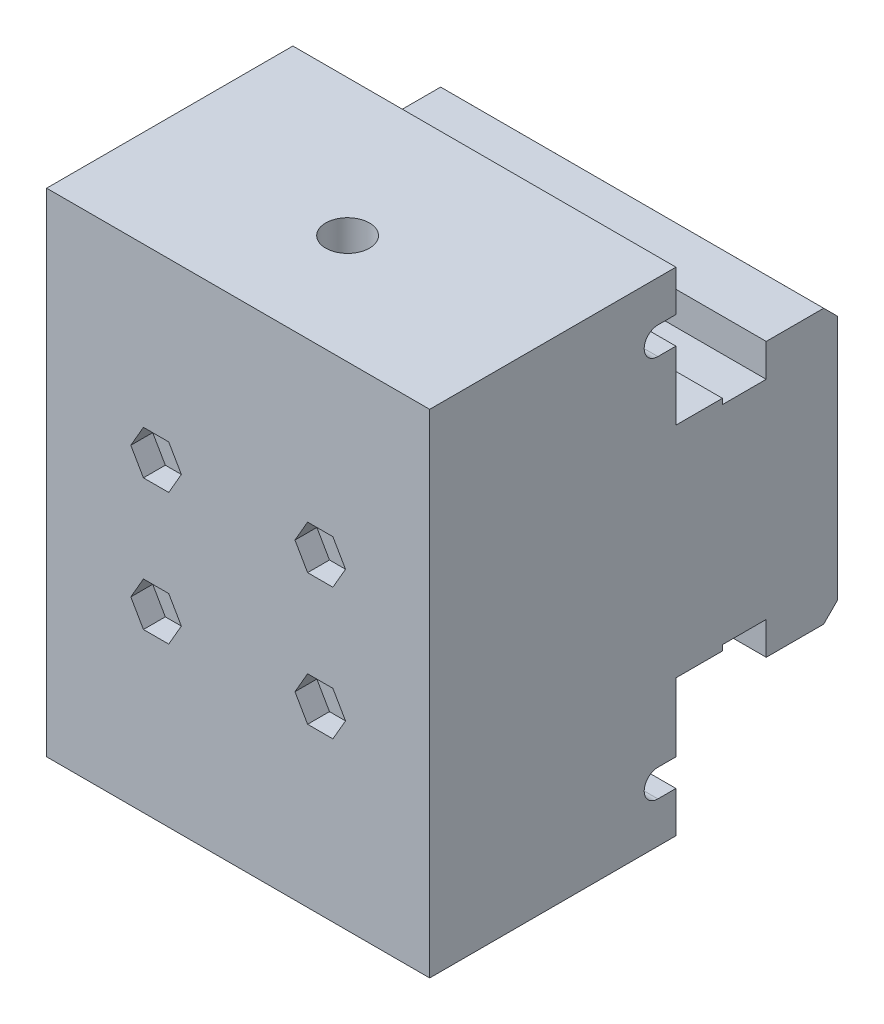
ISO-10303-21;
HEADER;
FILE_DESCRIPTION(('STEP AP214'),'2;1');
FILE_NAME('part.step','',(''),(''),'','','');
FILE_SCHEMA(('AUTOMOTIVE_DESIGN { 1 0 10303 214 1 1 1 1 }'));
ENDSEC;
DATA;
#1=APPLICATION_CONTEXT('core data for automotive mechanical design processes');
#2=APPLICATION_PROTOCOL_DEFINITION('international standard','automotive_design',2000,#1);
#3=PRODUCT_CONTEXT('',#1,'mechanical');
#4=PRODUCT('Part','Part','',(#3));
#5=PRODUCT_RELATED_PRODUCT_CATEGORY('part','',(#4));
#6=PRODUCT_DEFINITION_FORMATION('','',#4);
#7=PRODUCT_DEFINITION_CONTEXT('part definition',#1,'design');
#8=PRODUCT_DEFINITION('design','',#6,#7);
#9=PRODUCT_DEFINITION_SHAPE('','',#8);
#10=(LENGTH_UNIT() NAMED_UNIT(*) SI_UNIT(.MILLI.,.METRE.));
#11=(NAMED_UNIT(*) PLANE_ANGLE_UNIT() SI_UNIT($,.RADIAN.));
#12=(NAMED_UNIT(*) SI_UNIT($,.STERADIAN.) SOLID_ANGLE_UNIT());
#13=UNCERTAINTY_MEASURE_WITH_UNIT(LENGTH_MEASURE(1.E-05),#10,'distance_accuracy_value','');
#14=(GEOMETRIC_REPRESENTATION_CONTEXT(3) GLOBAL_UNCERTAINTY_ASSIGNED_CONTEXT((#13)) GLOBAL_UNIT_ASSIGNED_CONTEXT((#10,
#11,#12)) REPRESENTATION_CONTEXT('',''));
#15=CARTESIAN_POINT('',(0.,0.,0.));
#16=DIRECTION('',(0.,0.,1.));
#17=DIRECTION('',(1.,0.,0.));
#18=AXIS2_PLACEMENT_3D('',#15,#16,#17);
#19=CARTESIAN_POINT('',(70.,-45.0000595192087,0.));
#20=DIRECTION('',(0.,0.,1.));
#21=DIRECTION('',(1.,0.,0.));
#22=AXIS2_PLACEMENT_3D('',#19,#20,#21);
#23=PLANE('',#22);
#24=DIRECTION('',(0.,1.,0.));
#25=VECTOR('',#24,1.);
#26=CARTESIAN_POINT('',(70.,-45.0000595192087,0.));
#27=LINE('',#26,#25);
#28=CARTESIAN_POINT('',(70.,-32.5018302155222,0.));
#29=VERTEX_POINT('',#28);
#30=CARTESIAN_POINT('',(70.,-20.0004166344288,0.));
#31=VERTEX_POINT('',#30);
#32=EDGE_CURVE('E395',#29,#31,#27,.T.);
#33=ORIENTED_EDGE('',*,*,#32,.F.);
#34=DIRECTION('',(1.,0.,0.));
#35=VECTOR('',#34,1.);
#36=CARTESIAN_POINT('',(0.,-32.5018302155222,0.));
#37=LINE('',#36,#35);
#38=CARTESIAN_POINT('',(0.,-32.5018302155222,0.));
#39=VERTEX_POINT('',#38);
#40=EDGE_CURVE('E503',#39,#29,#37,.T.);
#41=ORIENTED_EDGE('',*,*,#40,.F.);
#42=DIRECTION('',(0.,1.,0.));
#43=VECTOR('',#42,1.);
#44=CARTESIAN_POINT('',(0.,-45.0000595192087,0.));
#45=LINE('',#44,#43);
#46=CARTESIAN_POINT('',(0.,-20.0004166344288,0.));
#47=VERTEX_POINT('',#46);
#48=EDGE_CURVE('E357',#39,#47,#45,.T.);
#49=ORIENTED_EDGE('',*,*,#48,.T.);
#50=DIRECTION('',(-1.,0.,0.));
#51=VECTOR('',#50,1.);
#52=CARTESIAN_POINT('',(70.,-20.0004166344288,0.));
#53=LINE('',#52,#51);
#54=EDGE_CURVE('E9',#31,#47,#53,.T.);
#55=ORIENTED_EDGE('',*,*,#54,.F.);
#56=EDGE_LOOP('',(#33,#41,#49,#55));
#57=FACE_BOUND('',#56,.T.);
#58=ADVANCED_FACE('F14',(#57),#23,.F.);
#59=CARTESIAN_POINT('',(70.,19.9992262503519,0.));
#60=DIRECTION('',(0.,0.,1.));
#61=DIRECTION('',(1.,0.,0.));
#62=AXIS2_PLACEMENT_3D('',#59,#60,#61);
#63=PLANE('',#62);
#64=DIRECTION('',(0.,1.,0.));
#65=VECTOR('',#64,1.);
#66=CARTESIAN_POINT('',(0.,19.9992262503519,0.));
#67=LINE('',#66,#65);
#68=CARTESIAN_POINT('',(0.,19.9992262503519,0.));
#69=VERTEX_POINT('',#68);
#70=CARTESIAN_POINT('',(0.,32.5018302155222,0.));
#71=VERTEX_POINT('',#70);
#72=EDGE_CURVE('E389',#69,#71,#67,.T.);
#73=ORIENTED_EDGE('',*,*,#72,.T.);
#74=DIRECTION('',(1.,0.,0.));
#75=VECTOR('',#74,1.);
#76=CARTESIAN_POINT('',(0.,32.5018302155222,0.));
#77=LINE('',#76,#75);
#78=CARTESIAN_POINT('',(70.,32.5018302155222,0.));
#79=VERTEX_POINT('',#78);
#80=EDGE_CURVE('E525',#71,#79,#77,.T.);
#81=ORIENTED_EDGE('',*,*,#80,.T.);
#82=DIRECTION('',(0.,1.,0.));
#83=VECTOR('',#82,1.);
#84=CARTESIAN_POINT('',(70.,19.9992262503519,0.));
#85=LINE('',#84,#83);
#86=CARTESIAN_POINT('',(70.,19.9992262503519,0.));
#87=VERTEX_POINT('',#86);
#88=EDGE_CURVE('E424',#87,#79,#85,.T.);
#89=ORIENTED_EDGE('',*,*,#88,.F.);
#90=DIRECTION('',(-1.,0.,0.));
#91=VECTOR('',#90,1.);
#92=CARTESIAN_POINT('',(70.,19.9992262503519,0.));
#93=LINE('',#92,#91);
#94=EDGE_CURVE('E427',#87,#69,#93,.T.);
#95=ORIENTED_EDGE('',*,*,#94,.T.);
#96=EDGE_LOOP('',(#73,#81,#89,#95));
#97=FACE_BOUND('',#96,.T.);
#98=ADVANCED_FACE('F762',(#97),#63,.F.);
#99=CARTESIAN_POINT('',(70.,45.0000595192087,45.));
#100=DIRECTION('',(0.,0.,-1.));
#101=DIRECTION('',(0.,1.,0.));
#102=AXIS2_PLACEMENT_3D('',#99,#100,#101);
#103=PLANE('',#102);
#104=DIRECTION('',(-0.5,-0.866025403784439,0.));
#105=VECTOR('',#104,1.);
#106=CARTESIAN_POINT('',(15.381197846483,12.,45.));
#107=LINE('',#106,#105);
#108=CARTESIAN_POINT('',(17.6905989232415,16.,45.));
#109=VERTEX_POINT('',#108);
#110=CARTESIAN_POINT('',(15.381197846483,12.,45.));
#111=VERTEX_POINT('',#110);
#112=EDGE_CURVE('E535',#109,#111,#107,.T.);
#113=ORIENTED_EDGE('',*,*,#112,.F.);
#114=DIRECTION('',(-1.,0.,0.));
#115=VECTOR('',#114,1.);
#116=CARTESIAN_POINT('',(17.6905989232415,16.,45.));
#117=LINE('',#116,#115);
#118=CARTESIAN_POINT('',(22.3094010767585,16.,45.));
#119=VERTEX_POINT('',#118);
#120=EDGE_CURVE('E528',#119,#109,#117,.T.);
#121=ORIENTED_EDGE('',*,*,#120,.F.);
#122=DIRECTION('',(-0.5,0.866025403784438,0.));
#123=VECTOR('',#122,1.);
#124=CARTESIAN_POINT('',(22.3094010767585,16.,45.));
#125=LINE('',#124,#123);
#126=CARTESIAN_POINT('',(24.618802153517,12.,45.));
#127=VERTEX_POINT('',#126);
#128=EDGE_CURVE('E547',#127,#119,#125,.T.);
#129=ORIENTED_EDGE('',*,*,#128,.F.);
#130=DIRECTION('',(0.5,0.866025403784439,0.));
#131=VECTOR('',#130,1.);
#132=CARTESIAN_POINT('',(24.618802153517,12.,45.));
#133=LINE('',#132,#131);
#134=CARTESIAN_POINT('',(22.3094010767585,8.,45.));
#135=VERTEX_POINT('',#134);
#136=EDGE_CURVE('E544',#135,#127,#133,.T.);
#137=ORIENTED_EDGE('',*,*,#136,.F.);
#138=DIRECTION('',(1.,0.,0.));
#139=VECTOR('',#138,1.);
#140=CARTESIAN_POINT('',(22.3094010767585,8.,45.));
#141=LINE('',#140,#139);
#142=CARTESIAN_POINT('',(17.6905989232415,8.,45.));
#143=VERTEX_POINT('',#142);
#144=EDGE_CURVE('E541',#143,#135,#141,.T.);
#145=ORIENTED_EDGE('',*,*,#144,.F.);
#146=DIRECTION('',(0.5,-0.866025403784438,0.));
#147=VECTOR('',#146,1.);
#148=CARTESIAN_POINT('',(17.6905989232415,8.,45.));
#149=LINE('',#148,#147);
#150=EDGE_CURVE('E538',#111,#143,#149,.T.);
#151=ORIENTED_EDGE('',*,*,#150,.F.);
#152=EDGE_LOOP('',(#113,#121,#129,#137,#145,#151));
#153=FACE_BOUND('',#152,.T.);
#154=DIRECTION('',(-0.5,-0.866025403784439,0.));
#155=VECTOR('',#154,1.);
#156=CARTESIAN_POINT('',(45.381197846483,12.,45.));
#157=LINE('',#156,#155);
#158=CARTESIAN_POINT('',(47.6905989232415,16.,45.));
#159=VERTEX_POINT('',#158);
#160=CARTESIAN_POINT('',(45.381197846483,12.,45.));
#161=VERTEX_POINT('',#160);
#162=EDGE_CURVE('E583',#159,#161,#157,.T.);
#163=ORIENTED_EDGE('',*,*,#162,.F.);
#164=DIRECTION('',(-1.,0.,0.));
#165=VECTOR('',#164,1.);
#166=CARTESIAN_POINT('',(47.6905989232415,16.,45.));
#167=LINE('',#166,#165);
#168=CARTESIAN_POINT('',(52.3094010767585,16.,45.));
#169=VERTEX_POINT('',#168);
#170=EDGE_CURVE('E571',#169,#159,#167,.T.);
#171=ORIENTED_EDGE('',*,*,#170,.F.);
#172=DIRECTION('',(-0.5,0.866025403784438,0.));
#173=VECTOR('',#172,1.);
#174=CARTESIAN_POINT('',(52.3094010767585,16.,45.));
#175=LINE('',#174,#173);
#176=CARTESIAN_POINT('',(54.618802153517,12.,45.));
#177=VERTEX_POINT('',#176);
#178=EDGE_CURVE('E595',#177,#169,#175,.T.);
#179=ORIENTED_EDGE('',*,*,#178,.F.);
#180=DIRECTION('',(0.5,0.866025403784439,0.));
#181=VECTOR('',#180,1.);
#182=CARTESIAN_POINT('',(54.618802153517,12.,45.));
#183=LINE('',#182,#181);
#184=CARTESIAN_POINT('',(52.3094010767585,8.,45.));
#185=VERTEX_POINT('',#184);
#186=EDGE_CURVE('E592',#185,#177,#183,.T.);
#187=ORIENTED_EDGE('',*,*,#186,.F.);
#188=DIRECTION('',(1.,0.,0.));
#189=VECTOR('',#188,1.);
#190=CARTESIAN_POINT('',(52.3094010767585,8.,45.));
#191=LINE('',#190,#189);
#192=CARTESIAN_POINT('',(47.6905989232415,8.,45.));
#193=VERTEX_POINT('',#192);
#194=EDGE_CURVE('E589',#193,#185,#191,.T.);
#195=ORIENTED_EDGE('',*,*,#194,.F.);
#196=DIRECTION('',(0.5,-0.866025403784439,0.));
#197=VECTOR('',#196,1.);
#198=CARTESIAN_POINT('',(47.6905989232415,8.,45.));
#199=LINE('',#198,#197);
#200=EDGE_CURVE('E586',#161,#193,#199,.T.);
#201=ORIENTED_EDGE('',*,*,#200,.F.);
#202=EDGE_LOOP('',(#163,#171,#179,#187,#195,#201));
#203=FACE_BOUND('',#202,.T.);
#204=DIRECTION('',(-0.5,0.866025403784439,0.));
#205=VECTOR('',#204,1.);
#206=CARTESIAN_POINT('',(54.618802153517,-12.,45.));
#207=LINE('',#206,#205);
#208=CARTESIAN_POINT('',(54.618802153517,-12.,45.));
#209=VERTEX_POINT('',#208);
#210=CARTESIAN_POINT('',(52.3094010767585,-8.,45.));
#211=VERTEX_POINT('',#210);
#212=EDGE_CURVE('E631',#209,#211,#207,.T.);
#213=ORIENTED_EDGE('',*,*,#212,.F.);
#214=DIRECTION('',(0.5,0.866025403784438,0.));
#215=VECTOR('',#214,1.);
#216=CARTESIAN_POINT('',(52.3094010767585,-16.,45.));
#217=LINE('',#216,#215);
#218=CARTESIAN_POINT('',(52.3094010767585,-16.,45.));
#219=VERTEX_POINT('',#218);
#220=EDGE_CURVE('E619',#219,#209,#217,.T.);
#221=ORIENTED_EDGE('',*,*,#220,.F.);
#222=DIRECTION('',(1.,0.,0.));
#223=VECTOR('',#222,1.);
#224=CARTESIAN_POINT('',(47.6905989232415,-16.,45.));
#225=LINE('',#224,#223);
#226=CARTESIAN_POINT('',(47.6905989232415,-16.,45.));
#227=VERTEX_POINT('',#226);
#228=EDGE_CURVE('E643',#227,#219,#225,.T.);
#229=ORIENTED_EDGE('',*,*,#228,.F.);
#230=DIRECTION('',(0.5,-0.866025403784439,0.));
#231=VECTOR('',#230,1.);
#232=CARTESIAN_POINT('',(45.381197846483,-12.,45.));
#233=LINE('',#232,#231);
#234=CARTESIAN_POINT('',(45.381197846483,-12.,45.));
#235=VERTEX_POINT('',#234);
#236=EDGE_CURVE('E640',#235,#227,#233,.T.);
#237=ORIENTED_EDGE('',*,*,#236,.F.);
#238=DIRECTION('',(-0.5,-0.866025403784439,0.));
#239=VECTOR('',#238,1.);
#240=CARTESIAN_POINT('',(47.6905989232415,-8.,45.));
#241=LINE('',#240,#239);
#242=CARTESIAN_POINT('',(47.6905989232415,-8.,45.));
#243=VERTEX_POINT('',#242);
#244=EDGE_CURVE('E637',#243,#235,#241,.T.);
#245=ORIENTED_EDGE('',*,*,#244,.F.);
#246=DIRECTION('',(-1.,0.,0.));
#247=VECTOR('',#246,1.);
#248=CARTESIAN_POINT('',(52.3094010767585,-8.,45.));
#249=LINE('',#248,#247);
#250=EDGE_CURVE('E634',#211,#243,#249,.T.);
#251=ORIENTED_EDGE('',*,*,#250,.F.);
#252=EDGE_LOOP('',(#213,#221,#229,#237,#245,#251));
#253=FACE_BOUND('',#252,.T.);
#254=DIRECTION('',(-0.5,0.866025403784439,0.));
#255=VECTOR('',#254,1.);
#256=CARTESIAN_POINT('',(24.618802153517,-12.,45.));
#257=LINE('',#256,#255);
#258=CARTESIAN_POINT('',(24.618802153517,-12.,45.));
#259=VERTEX_POINT('',#258);
#260=CARTESIAN_POINT('',(22.3094010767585,-8.,45.));
#261=VERTEX_POINT('',#260);
#262=EDGE_CURVE('E679',#259,#261,#257,.T.);
#263=ORIENTED_EDGE('',*,*,#262,.F.);
#264=DIRECTION('',(0.5,0.866025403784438,0.));
#265=VECTOR('',#264,1.);
#266=CARTESIAN_POINT('',(22.3094010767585,-16.,45.));
#267=LINE('',#266,#265);
#268=CARTESIAN_POINT('',(22.3094010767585,-16.,45.));
#269=VERTEX_POINT('',#268);
#270=EDGE_CURVE('E667',#269,#259,#267,.T.);
#271=ORIENTED_EDGE('',*,*,#270,.F.);
#272=DIRECTION('',(1.,0.,0.));
#273=VECTOR('',#272,1.);
#274=CARTESIAN_POINT('',(17.6905989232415,-16.,45.));
#275=LINE('',#274,#273);
#276=CARTESIAN_POINT('',(17.6905989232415,-16.,45.));
#277=VERTEX_POINT('',#276);
#278=EDGE_CURVE('E691',#277,#269,#275,.T.);
#279=ORIENTED_EDGE('',*,*,#278,.F.);
#280=DIRECTION('',(0.5,-0.866025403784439,0.));
#281=VECTOR('',#280,1.);
#282=CARTESIAN_POINT('',(15.381197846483,-12.,45.));
#283=LINE('',#282,#281);
#284=CARTESIAN_POINT('',(15.381197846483,-12.,45.));
#285=VERTEX_POINT('',#284);
#286=EDGE_CURVE('E688',#285,#277,#283,.T.);
#287=ORIENTED_EDGE('',*,*,#286,.F.);
#288=DIRECTION('',(-0.5,-0.866025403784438,0.));
#289=VECTOR('',#288,1.);
#290=CARTESIAN_POINT('',(17.6905989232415,-8.,45.));
#291=LINE('',#290,#289);
#292=CARTESIAN_POINT('',(17.6905989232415,-8.,45.));
#293=VERTEX_POINT('',#292);
#294=EDGE_CURVE('E685',#293,#285,#291,.T.);
#295=ORIENTED_EDGE('',*,*,#294,.F.);
#296=DIRECTION('',(-1.,0.,0.));
#297=VECTOR('',#296,1.);
#298=CARTESIAN_POINT('',(22.3094010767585,-8.,45.));
#299=LINE('',#298,#297);
#300=EDGE_CURVE('E682',#261,#293,#299,.T.);
#301=ORIENTED_EDGE('',*,*,#300,.F.);
#302=EDGE_LOOP('',(#263,#271,#279,#287,#295,#301));
#303=FACE_BOUND('',#302,.T.);
#304=DIRECTION('',(0.,-1.,0.));
#305=VECTOR('',#304,1.);
#306=CARTESIAN_POINT('',(70.,45.0000595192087,45.));
#307=LINE('',#306,#305);
#308=CARTESIAN_POINT('',(70.,45.,45.));
#309=VERTEX_POINT('',#308);
#310=CARTESIAN_POINT('',(70.,-45.,45.));
#311=VERTEX_POINT('',#310);
#312=EDGE_CURVE('E392',#309,#311,#307,.T.);
#313=ORIENTED_EDGE('',*,*,#312,.F.);
#314=DIRECTION('',(-1.,0.,0.));
#315=VECTOR('',#314,1.);
#316=CARTESIAN_POINT('',(70.,45.,45.));
#317=LINE('',#316,#315);
#318=CARTESIAN_POINT('',(0.,45.,45.));
#319=VERTEX_POINT('',#318);
#320=EDGE_CURVE('E481',#309,#319,#317,.T.);
#321=ORIENTED_EDGE('',*,*,#320,.T.);
#322=DIRECTION('',(0.,-1.,0.));
#323=VECTOR('',#322,1.);
#324=CARTESIAN_POINT('',(0.,45.0000595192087,45.));
#325=LINE('',#324,#323);
#326=CARTESIAN_POINT('',(0.,-45.,45.));
#327=VERTEX_POINT('',#326);
#328=EDGE_CURVE('E361',#319,#327,#325,.T.);
#329=ORIENTED_EDGE('',*,*,#328,.T.);
#330=DIRECTION('',(1.,0.,0.));
#331=VECTOR('',#330,1.);
#332=CARTESIAN_POINT('',(70.,-45.,45.));
#333=LINE('',#332,#331);
#334=EDGE_CURVE('E39',#327,#311,#333,.T.);
#335=ORIENTED_EDGE('',*,*,#334,.T.);
#336=EDGE_LOOP('',(#313,#321,#329,#335));
#337=FACE_BOUND('',#336,.T.);
#338=ADVANCED_FACE('F16',(#153,#203,#253,#303,#337),#103,.F.);
#339=CARTESIAN_POINT('',(70.,-45.,0.));
#340=VERTEX_POINT('',#339);
#341=CARTESIAN_POINT('',(70.,-37.5014433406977,0.));
#342=VERTEX_POINT('',#341);
#343=EDGE_CURVE('E348',#340,#342,#27,.T.);
#344=ORIENTED_EDGE('',*,*,#343,.F.);
#345=DIRECTION('',(-1.,0.,0.));
#346=VECTOR('',#345,1.);
#347=CARTESIAN_POINT('',(70.,-45.,0.));
#348=LINE('',#347,#346);
#349=CARTESIAN_POINT('',(0.,-45.,0.));
#350=VERTEX_POINT('',#349);
#351=EDGE_CURVE('E333',#340,#350,#348,.T.);
#352=ORIENTED_EDGE('',*,*,#351,.T.);
#353=CARTESIAN_POINT('',(0.,-37.5014433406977,0.));
#354=VERTEX_POINT('',#353);
#355=EDGE_CURVE('E346',#350,#354,#45,.T.);
#356=ORIENTED_EDGE('',*,*,#355,.T.);
#357=DIRECTION('',(1.,0.,0.));
#358=VECTOR('',#357,1.);
#359=CARTESIAN_POINT('',(0.,-37.5014433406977,0.));
#360=LINE('',#359,#358);
#361=EDGE_CURVE('E505',#354,#342,#360,.T.);
#362=ORIENTED_EDGE('',*,*,#361,.T.);
#363=EDGE_LOOP('',(#344,#352,#356,#362));
#364=FACE_BOUND('',#363,.T.);
#365=ADVANCED_FACE('F344',(#364),#23,.F.);
#366=CARTESIAN_POINT('',(70.,-20.0004166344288,-8.49934231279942));
#367=DIRECTION('',(0.,1.,0.));
#368=DIRECTION('',(-1.,0.,0.));
#369=AXIS2_PLACEMENT_3D('',#366,#367,#368);
#370=PLANE('',#369);
#371=DIRECTION('',(0.,0.,-1.));
#372=VECTOR('',#371,1.);
#373=CARTESIAN_POINT('',(0.,-20.0004166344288,-8.49934231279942));
#374=LINE('',#373,#372);
#375=CARTESIAN_POINT('',(0.,-20.0004166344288,-8.49934231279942));
#376=VERTEX_POINT('',#375);
#377=EDGE_CURVE('E356',#47,#376,#374,.T.);
#378=ORIENTED_EDGE('',*,*,#377,.T.);
#379=DIRECTION('',(-1.,0.,0.));
#380=VECTOR('',#379,1.);
#381=CARTESIAN_POINT('',(70.,-20.0004166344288,-8.49934231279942));
#382=LINE('',#381,#380);
#383=CARTESIAN_POINT('',(70.,-20.0004166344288,-8.49934231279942));
#384=VERTEX_POINT('',#383);
#385=EDGE_CURVE('E23',#384,#376,#382,.T.);
#386=ORIENTED_EDGE('',*,*,#385,.F.);
#387=DIRECTION('',(0.,0.,-1.));
#388=VECTOR('',#387,1.);
#389=CARTESIAN_POINT('',(70.,-20.0004166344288,-8.49934231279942));
#390=LINE('',#389,#388);
#391=EDGE_CURVE('E397',#31,#384,#390,.T.);
#392=ORIENTED_EDGE('',*,*,#391,.F.);
#393=ORIENTED_EDGE('',*,*,#54,.T.);
#394=EDGE_LOOP('',(#378,#386,#392,#393));
#395=FACE_BOUND('',#394,.T.);
#396=ADVANCED_FACE('F774',(#395),#370,.F.);
#397=CARTESIAN_POINT('',(70.,-19.0004940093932,-8.49934231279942));
#398=DIRECTION('',(0.,0.,1.));
#399=DIRECTION('',(1.,0.,0.));
#400=AXIS2_PLACEMENT_3D('',#397,#398,#399);
#401=PLANE('',#400);
#402=DIRECTION('',(0.,1.,0.));
#403=VECTOR('',#402,1.);
#404=CARTESIAN_POINT('',(0.,-19.0004940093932,-8.49934231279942));
#405=LINE('',#404,#403);
#406=CARTESIAN_POINT('',(0.,-19.0004940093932,-8.49934231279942));
#407=VERTEX_POINT('',#406);
#408=EDGE_CURVE('E359',#376,#407,#405,.T.);
#409=ORIENTED_EDGE('',*,*,#408,.T.);
#410=DIRECTION('',(-1.,0.,0.));
#411=VECTOR('',#410,1.);
#412=CARTESIAN_POINT('',(70.,-19.0004940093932,-8.49934231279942));
#413=LINE('',#412,#411);
#414=CARTESIAN_POINT('',(70.,-19.0004940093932,-8.49934231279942));
#415=VERTEX_POINT('',#414);
#416=EDGE_CURVE('E460',#415,#407,#413,.T.);
#417=ORIENTED_EDGE('',*,*,#416,.F.);
#418=DIRECTION('',(0.,1.,0.));
#419=VECTOR('',#418,1.);
#420=CARTESIAN_POINT('',(70.,-19.0004940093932,-8.49934231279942));
#421=LINE('',#420,#419);
#422=EDGE_CURVE('E399',#384,#415,#421,.T.);
#423=ORIENTED_EDGE('',*,*,#422,.F.);
#424=ORIENTED_EDGE('',*,*,#385,.T.);
#425=EDGE_LOOP('',(#409,#417,#423,#424));
#426=FACE_BOUND('',#425,.T.);
#427=ADVANCED_FACE('F780',(#426),#401,.F.);
#428=CARTESIAN_POINT('',(70.,-19.0004940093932,-8.49934231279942));
#429=DIRECTION('',(0.,1.,0.));
#430=DIRECTION('',(-1.,0.,0.));
#431=AXIS2_PLACEMENT_3D('',#428,#429,#430);
#432=PLANE('',#431);
#433=DIRECTION('',(0.,0.,-1.));
#434=VECTOR('',#433,1.);
#435=CARTESIAN_POINT('',(0.,-19.0004940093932,-8.49934231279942));
#436=LINE('',#435,#434);
#437=CARTESIAN_POINT('',(0.,-19.0004940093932,-16.4999136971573));
#438=VERTEX_POINT('',#437);
#439=EDGE_CURVE('E366',#407,#438,#436,.T.);
#440=ORIENTED_EDGE('',*,*,#439,.T.);
#441=DIRECTION('',(-1.,0.,0.));
#442=VECTOR('',#441,1.);
#443=CARTESIAN_POINT('',(70.,-19.0004940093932,-16.4999136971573));
#444=LINE('',#443,#442);
#445=CARTESIAN_POINT('',(70.,-19.0004940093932,-16.4999136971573));
#446=VERTEX_POINT('',#445);
#447=EDGE_CURVE('E457',#446,#438,#444,.T.);
#448=ORIENTED_EDGE('',*,*,#447,.F.);
#449=DIRECTION('',(0.,0.,-1.));
#450=VECTOR('',#449,1.);
#451=CARTESIAN_POINT('',(70.,-19.0004940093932,-8.49934231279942));
#452=LINE('',#451,#450);
#453=EDGE_CURVE('E401',#415,#446,#452,.T.);
#454=ORIENTED_EDGE('',*,*,#453,.F.);
#455=ORIENTED_EDGE('',*,*,#416,.T.);
#456=EDGE_LOOP('',(#440,#448,#454,#455));
#457=FACE_BOUND('',#456,.T.);
#458=ADVANCED_FACE('F903',(#457),#432,.F.);
#459=CARTESIAN_POINT('',(70.,-25.0000297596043,-16.4999136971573));
#460=DIRECTION('',(0.,0.,-1.));
#461=DIRECTION('',(-1.,0.,0.));
#462=AXIS2_PLACEMENT_3D('',#459,#460,#461);
#463=PLANE('',#462);
#464=DIRECTION('',(0.,-1.,0.));
#465=VECTOR('',#464,1.);
#466=CARTESIAN_POINT('',(0.,-25.0000297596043,-16.4999136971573));
#467=LINE('',#466,#465);
#468=CARTESIAN_POINT('',(0.,-25.0000297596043,-16.4999136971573));
#469=VERTEX_POINT('',#468);
#470=EDGE_CURVE('E368',#438,#469,#467,.T.);
#471=ORIENTED_EDGE('',*,*,#470,.T.);
#472=DIRECTION('',(-1.,0.,0.));
#473=VECTOR('',#472,1.);
#474=CARTESIAN_POINT('',(70.,-25.0000297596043,-16.4999136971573));
#475=LINE('',#474,#473);
#476=CARTESIAN_POINT('',(70.,-25.0000297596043,-16.4999136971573));
#477=VERTEX_POINT('',#476);
#478=EDGE_CURVE('E454',#477,#469,#475,.T.);
#479=ORIENTED_EDGE('',*,*,#478,.F.);
#480=DIRECTION('',(0.,-1.,0.));
#481=VECTOR('',#480,1.);
#482=CARTESIAN_POINT('',(70.,-25.0000297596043,-16.4999136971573));
#483=LINE('',#482,#481);
#484=EDGE_CURVE('E403',#446,#477,#483,.T.);
#485=ORIENTED_EDGE('',*,*,#484,.F.);
#486=ORIENTED_EDGE('',*,*,#447,.T.);
#487=EDGE_LOOP('',(#471,#479,#485,#486));
#488=FACE_BOUND('',#487,.T.);
#489=ADVANCED_FACE('F899',(#488),#463,.F.);
#490=CARTESIAN_POINT('',(70.,-25.0000297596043,-26.9992560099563));
#491=DIRECTION('',(0.,1.,0.));
#492=DIRECTION('',(-1.,0.,0.));
#493=AXIS2_PLACEMENT_3D('',#490,#491,#492);
#494=PLANE('',#493);
#495=DIRECTION('',(0.,0.,-1.));
#496=VECTOR('',#495,1.);
#497=CARTESIAN_POINT('',(0.,-25.0000297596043,-26.9992560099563));
#498=LINE('',#497,#496);
#499=CARTESIAN_POINT('',(0.,-25.0000297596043,-26.9992560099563));
#500=VERTEX_POINT('',#499);
#501=EDGE_CURVE('E370',#469,#500,#498,.T.);
#502=ORIENTED_EDGE('',*,*,#501,.T.);
#503=DIRECTION('',(-1.,0.,0.));
#504=VECTOR('',#503,1.);
#505=CARTESIAN_POINT('',(70.,-25.0000297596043,-26.9992560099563));
#506=LINE('',#505,#504);
#507=CARTESIAN_POINT('',(70.,-25.0000297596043,-26.9992560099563));
#508=VERTEX_POINT('',#507);
#509=EDGE_CURVE('E451',#508,#500,#506,.T.);
#510=ORIENTED_EDGE('',*,*,#509,.F.);
#511=DIRECTION('',(0.,0.,-1.));
#512=VECTOR('',#511,1.);
#513=CARTESIAN_POINT('',(70.,-25.0000297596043,-26.9992560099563));
#514=LINE('',#513,#512);
#515=EDGE_CURVE('E405',#477,#508,#514,.T.);
#516=ORIENTED_EDGE('',*,*,#515,.F.);
#517=ORIENTED_EDGE('',*,*,#478,.T.);
#518=EDGE_LOOP('',(#502,#510,#516,#517));
#519=FACE_BOUND('',#518,.T.);
#520=ADVANCED_FACE('F895',(#519),#494,.F.);
#521=CARTESIAN_POINT('',(70.,-22.5002231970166,-29.5002529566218));
#522=DIRECTION('',(0.,0.707275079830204,0.706938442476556));
#523=DIRECTION('',(0.,-0.706938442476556,0.707275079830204));
#524=AXIS2_PLACEMENT_3D('',#521,#522,#523);
#525=PLANE('',#524);
#526=DIRECTION('',(0.,0.706938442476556,-0.707275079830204));
#527=VECTOR('',#526,1.);
#528=CARTESIAN_POINT('',(0.,-22.5002231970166,-29.5002529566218));
#529=LINE('',#528,#527);
#530=CARTESIAN_POINT('',(0.,-22.5002231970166,-29.5002529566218));
#531=VERTEX_POINT('',#530);
#532=EDGE_CURVE('E372',#500,#531,#529,.T.);
#533=ORIENTED_EDGE('',*,*,#532,.T.);
#534=DIRECTION('',(-1.,0.,0.));
#535=VECTOR('',#534,1.);
#536=CARTESIAN_POINT('',(70.,-22.5002231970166,-29.5002529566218));
#537=LINE('',#536,#535);
#538=CARTESIAN_POINT('',(70.,-22.5002231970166,-29.5002529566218));
#539=VERTEX_POINT('',#538);
#540=EDGE_CURVE('E448',#539,#531,#537,.T.);
#541=ORIENTED_EDGE('',*,*,#540,.F.);
#542=DIRECTION('',(0.,0.706938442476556,-0.707275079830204));
#543=VECTOR('',#542,1.);
#544=CARTESIAN_POINT('',(70.,-22.5002231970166,-29.5002529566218));
#545=LINE('',#544,#543);
#546=EDGE_CURVE('E407',#508,#539,#545,.T.);
#547=ORIENTED_EDGE('',*,*,#546,.F.);
#548=ORIENTED_EDGE('',*,*,#509,.T.);
#549=EDGE_LOOP('',(#533,#541,#547,#548));
#550=FACE_BOUND('',#549,.T.);
#551=ADVANCED_FACE('F891',(#550),#525,.F.);
#552=CARTESIAN_POINT('',(70.,22.5002231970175,-29.5002529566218));
#553=DIRECTION('',(0.,0.,1.));
#554=DIRECTION('',(1.,0.,0.));
#555=AXIS2_PLACEMENT_3D('',#552,#553,#554);
#556=PLANE('',#555);
#557=DIRECTION('',(0.,1.,0.));
#558=VECTOR('',#557,1.);
#559=CARTESIAN_POINT('',(0.,22.5002231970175,-29.5002529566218));
#560=LINE('',#559,#558);
#561=CARTESIAN_POINT('',(0.,22.5002231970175,-29.5002529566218));
#562=VERTEX_POINT('',#561);
#563=EDGE_CURVE('E374',#531,#562,#560,.T.);
#564=ORIENTED_EDGE('',*,*,#563,.T.);
#565=DIRECTION('',(-1.,0.,0.));
#566=VECTOR('',#565,1.);
#567=CARTESIAN_POINT('',(70.,22.5002231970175,-29.5002529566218));
#568=LINE('',#567,#566);
#569=CARTESIAN_POINT('',(70.,22.5002231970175,-29.5002529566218));
#570=VERTEX_POINT('',#569);
#571=EDGE_CURVE('E445',#570,#562,#568,.T.);
#572=ORIENTED_EDGE('',*,*,#571,.F.);
#573=DIRECTION('',(0.,1.,0.));
#574=VECTOR('',#573,1.);
#575=CARTESIAN_POINT('',(70.,22.5002231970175,-29.5002529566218));
#576=LINE('',#575,#574);
#577=EDGE_CURVE('E409',#539,#570,#576,.T.);
#578=ORIENTED_EDGE('',*,*,#577,.F.);
#579=ORIENTED_EDGE('',*,*,#540,.T.);
#580=EDGE_LOOP('',(#564,#572,#578,#579));
#581=FACE_BOUND('',#580,.T.);
#582=ADVANCED_FACE('F887',(#581),#556,.F.);
#583=CARTESIAN_POINT('',(70.,25.0000297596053,-26.9992560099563));
#584=DIRECTION('',(0.,-0.707275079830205,0.706938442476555));
#585=DIRECTION('',(0.,-0.706938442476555,-0.707275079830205));
#586=AXIS2_PLACEMENT_3D('',#583,#584,#585);
#587=PLANE('',#586);
#588=DIRECTION('',(0.,0.706938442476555,0.707275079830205));
#589=VECTOR('',#588,1.);
#590=CARTESIAN_POINT('',(0.,25.0000297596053,-26.9992560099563));
#591=LINE('',#590,#589);
#592=CARTESIAN_POINT('',(0.,25.0000297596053,-26.9992560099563));
#593=VERTEX_POINT('',#592);
#594=EDGE_CURVE('E376',#562,#593,#591,.T.);
#595=ORIENTED_EDGE('',*,*,#594,.T.);
#596=DIRECTION('',(-1.,0.,0.));
#597=VECTOR('',#596,1.);
#598=CARTESIAN_POINT('',(70.,25.0000297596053,-26.9992560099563));
#599=LINE('',#598,#597);
#600=CARTESIAN_POINT('',(70.,25.0000297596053,-26.9992560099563));
#601=VERTEX_POINT('',#600);
#602=EDGE_CURVE('E442',#601,#593,#599,.T.);
#603=ORIENTED_EDGE('',*,*,#602,.F.);
#604=DIRECTION('',(0.,0.706938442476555,0.707275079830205));
#605=VECTOR('',#604,1.);
#606=CARTESIAN_POINT('',(70.,25.0000297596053,-26.9992560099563));
#607=LINE('',#606,#605);
#608=EDGE_CURVE('E411',#570,#601,#607,.T.);
#609=ORIENTED_EDGE('',*,*,#608,.F.);
#610=ORIENTED_EDGE('',*,*,#571,.T.);
#611=EDGE_LOOP('',(#595,#603,#609,#610));
#612=FACE_BOUND('',#611,.T.);
#613=ADVANCED_FACE('F883',(#612),#587,.F.);
#614=CARTESIAN_POINT('',(70.,25.0000297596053,-16.4999136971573));
#615=DIRECTION('',(0.,-1.,0.));
#616=DIRECTION('',(1.,0.,0.));
#617=AXIS2_PLACEMENT_3D('',#614,#615,#616);
#618=PLANE('',#617);
#619=DIRECTION('',(0.,0.,1.));
#620=VECTOR('',#619,1.);
#621=CARTESIAN_POINT('',(0.,25.0000297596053,-16.4999136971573));
#622=LINE('',#621,#620);
#623=CARTESIAN_POINT('',(0.,25.0000297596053,-16.4999136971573));
#624=VERTEX_POINT('',#623);
#625=EDGE_CURVE('E378',#593,#624,#622,.T.);
#626=ORIENTED_EDGE('',*,*,#625,.T.);
#627=DIRECTION('',(-1.,0.,0.));
#628=VECTOR('',#627,1.);
#629=CARTESIAN_POINT('',(70.,25.0000297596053,-16.4999136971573));
#630=LINE('',#629,#628);
#631=CARTESIAN_POINT('',(70.,25.0000297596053,-16.4999136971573));
#632=VERTEX_POINT('',#631);
#633=EDGE_CURVE('E439',#632,#624,#630,.T.);
#634=ORIENTED_EDGE('',*,*,#633,.F.);
#635=DIRECTION('',(0.,0.,1.));
#636=VECTOR('',#635,1.);
#637=CARTESIAN_POINT('',(70.,25.0000297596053,-16.4999136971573));
#638=LINE('',#637,#636);
#639=EDGE_CURVE('E413',#601,#632,#638,.T.);
#640=ORIENTED_EDGE('',*,*,#639,.F.);
#641=ORIENTED_EDGE('',*,*,#602,.T.);
#642=EDGE_LOOP('',(#626,#634,#640,#641));
#643=FACE_BOUND('',#642,.T.);
#644=ADVANCED_FACE('F879',(#643),#618,.F.);
#645=CARTESIAN_POINT('',(70.,18.9993036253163,-16.4999136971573));
#646=DIRECTION('',(0.,0.,-1.));
#647=DIRECTION('',(-1.,0.,0.));
#648=AXIS2_PLACEMENT_3D('',#645,#646,#647);
#649=PLANE('',#648);
#650=DIRECTION('',(0.,-1.,0.));
#651=VECTOR('',#650,1.);
#652=CARTESIAN_POINT('',(0.,18.9993036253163,-16.4999136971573));
#653=LINE('',#652,#651);
#654=CARTESIAN_POINT('',(0.,18.9993036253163,-16.4999136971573));
#655=VERTEX_POINT('',#654);
#656=EDGE_CURVE('E380',#624,#655,#653,.T.);
#657=ORIENTED_EDGE('',*,*,#656,.T.);
#658=DIRECTION('',(-1.,0.,0.));
#659=VECTOR('',#658,1.);
#660=CARTESIAN_POINT('',(70.,18.9993036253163,-16.4999136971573));
#661=LINE('',#660,#659);
#662=CARTESIAN_POINT('',(70.,18.9993036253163,-16.4999136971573));
#663=VERTEX_POINT('',#662);
#664=EDGE_CURVE('E436',#663,#655,#661,.T.);
#665=ORIENTED_EDGE('',*,*,#664,.F.);
#666=DIRECTION('',(0.,-1.,0.));
#667=VECTOR('',#666,1.);
#668=CARTESIAN_POINT('',(70.,18.9993036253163,-16.4999136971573));
#669=LINE('',#668,#667);
#670=EDGE_CURVE('E415',#632,#663,#669,.T.);
#671=ORIENTED_EDGE('',*,*,#670,.F.);
#672=ORIENTED_EDGE('',*,*,#633,.T.);
#673=EDGE_LOOP('',(#657,#665,#671,#672));
#674=FACE_BOUND('',#673,.T.);
#675=ADVANCED_FACE('F875',(#674),#649,.F.);
#676=CARTESIAN_POINT('',(70.,18.9993036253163,-16.4999136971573));
#677=DIRECTION('',(0.,-1.,0.));
#678=DIRECTION('',(1.,0.,0.));
#679=AXIS2_PLACEMENT_3D('',#676,#677,#678);
#680=PLANE('',#679);
#681=DIRECTION('',(0.,0.,1.));
#682=VECTOR('',#681,1.);
#683=CARTESIAN_POINT('',(0.,18.9993036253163,-16.4999136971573));
#684=LINE('',#683,#682);
#685=CARTESIAN_POINT('',(0.,18.9993036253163,-8.49934231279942));
#686=VERTEX_POINT('',#685);
#687=EDGE_CURVE('E382',#655,#686,#684,.T.);
#688=ORIENTED_EDGE('',*,*,#687,.T.);
#689=DIRECTION('',(-1.,0.,0.));
#690=VECTOR('',#689,1.);
#691=CARTESIAN_POINT('',(70.,18.9993036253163,-8.49934231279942));
#692=LINE('',#691,#690);
#693=CARTESIAN_POINT('',(70.,18.9993036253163,-8.49934231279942));
#694=VERTEX_POINT('',#693);
#695=EDGE_CURVE('E433',#694,#686,#692,.T.);
#696=ORIENTED_EDGE('',*,*,#695,.F.);
#697=DIRECTION('',(0.,0.,1.));
#698=VECTOR('',#697,1.);
#699=CARTESIAN_POINT('',(70.,18.9993036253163,-16.4999136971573));
#700=LINE('',#699,#698);
#701=EDGE_CURVE('E417',#663,#694,#700,.T.);
#702=ORIENTED_EDGE('',*,*,#701,.F.);
#703=ORIENTED_EDGE('',*,*,#664,.T.);
#704=EDGE_LOOP('',(#688,#696,#702,#703));
#705=FACE_BOUND('',#704,.T.);
#706=ADVANCED_FACE('F871',(#705),#680,.F.);
#707=CARTESIAN_POINT('',(70.,19.9992262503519,-8.49934231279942));
#708=DIRECTION('',(0.,0.,1.));
#709=DIRECTION('',(1.,0.,0.));
#710=AXIS2_PLACEMENT_3D('',#707,#708,#709);
#711=PLANE('',#710);
#712=DIRECTION('',(0.,1.,0.));
#713=VECTOR('',#712,1.);
#714=CARTESIAN_POINT('',(0.,19.9992262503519,-8.49934231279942));
#715=LINE('',#714,#713);
#716=CARTESIAN_POINT('',(0.,19.9992262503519,-8.49934231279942));
#717=VERTEX_POINT('',#716);
#718=EDGE_CURVE('E384',#686,#717,#715,.T.);
#719=ORIENTED_EDGE('',*,*,#718,.T.);
#720=DIRECTION('',(-1.,0.,0.));
#721=VECTOR('',#720,1.);
#722=CARTESIAN_POINT('',(70.,19.9992262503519,-8.49934231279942));
#723=LINE('',#722,#721);
#724=CARTESIAN_POINT('',(70.,19.9992262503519,-8.49934231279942));
#725=VERTEX_POINT('',#724);
#726=EDGE_CURVE('E430',#725,#717,#723,.T.);
#727=ORIENTED_EDGE('',*,*,#726,.F.);
#728=DIRECTION('',(0.,1.,0.));
#729=VECTOR('',#728,1.);
#730=CARTESIAN_POINT('',(70.,19.9992262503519,-8.49934231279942));
#731=LINE('',#730,#729);
#732=EDGE_CURVE('E419',#694,#725,#731,.T.);
#733=ORIENTED_EDGE('',*,*,#732,.F.);
#734=ORIENTED_EDGE('',*,*,#695,.T.);
#735=EDGE_LOOP('',(#719,#727,#733,#734));
#736=FACE_BOUND('',#735,.T.);
#737=ADVANCED_FACE('F867',(#736),#711,.F.);
#738=CARTESIAN_POINT('',(70.,19.9992262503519,0.));
#739=DIRECTION('',(0.,-1.,0.));
#740=DIRECTION('',(1.,0.,0.));
#741=AXIS2_PLACEMENT_3D('',#738,#739,#740);
#742=PLANE('',#741);
#743=DIRECTION('',(0.,0.,1.));
#744=VECTOR('',#743,1.);
#745=CARTESIAN_POINT('',(0.,19.9992262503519,0.));
#746=LINE('',#745,#744);
#747=EDGE_CURVE('E386',#717,#69,#746,.T.);
#748=ORIENTED_EDGE('',*,*,#747,.T.);
#749=ORIENTED_EDGE('',*,*,#94,.F.);
#750=DIRECTION('',(0.,0.,1.));
#751=VECTOR('',#750,1.);
#752=CARTESIAN_POINT('',(70.,19.9992262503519,0.));
#753=LINE('',#752,#751);
#754=EDGE_CURVE('E421',#725,#87,#753,.T.);
#755=ORIENTED_EDGE('',*,*,#754,.F.);
#756=ORIENTED_EDGE('',*,*,#726,.T.);
#757=EDGE_LOOP('',(#748,#749,#755,#756));
#758=FACE_BOUND('',#757,.T.);
#759=ADVANCED_FACE('F863',(#758),#742,.F.);
#760=CARTESIAN_POINT('',(0.,37.5014433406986,0.));
#761=VERTEX_POINT('',#760);
#762=CARTESIAN_POINT('',(0.,45.,0.));
#763=VERTEX_POINT('',#762);
#764=EDGE_CURVE('E388',#761,#763,#67,.T.);
#765=ORIENTED_EDGE('',*,*,#764,.T.);
#766=DIRECTION('',(1.,0.,0.));
#767=VECTOR('',#766,1.);
#768=CARTESIAN_POINT('',(70.,45.,0.));
#769=LINE('',#768,#767);
#770=CARTESIAN_POINT('',(70.,45.,0.));
#771=VERTEX_POINT('',#770);
#772=EDGE_CURVE('E31',#763,#771,#769,.T.);
#773=ORIENTED_EDGE('',*,*,#772,.T.);
#774=CARTESIAN_POINT('',(70.,37.5014433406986,0.));
#775=VERTEX_POINT('',#774);
#776=EDGE_CURVE('E423',#775,#771,#85,.T.);
#777=ORIENTED_EDGE('',*,*,#776,.F.);
#778=DIRECTION('',(1.,0.,0.));
#779=VECTOR('',#778,1.);
#780=CARTESIAN_POINT('',(0.,37.5014433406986,0.));
#781=LINE('',#780,#779);
#782=EDGE_CURVE('E524',#761,#775,#781,.T.);
#783=ORIENTED_EDGE('',*,*,#782,.F.);
#784=EDGE_LOOP('',(#765,#773,#777,#783));
#785=FACE_BOUND('',#784,.T.);
#786=ADVANCED_FACE('F770',(#785),#63,.F.);
#787=CARTESIAN_POINT('',(70.,45.0000595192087,0.));
#788=DIRECTION('',(-1.,0.,0.));
#789=DIRECTION('',(0.,-1.,0.));
#790=AXIS2_PLACEMENT_3D('',#787,#788,#789);
#791=PLANE('',#790);
#792=ORIENTED_EDGE('',*,*,#776,.T.);
#793=DIRECTION('',(0.,0.,1.));
#794=VECTOR('',#793,1.);
#795=CARTESIAN_POINT('',(70.,45.,49.9063368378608));
#796=LINE('',#795,#794);
#797=EDGE_CURVE('E465',#771,#309,#796,.T.);
#798=ORIENTED_EDGE('',*,*,#797,.T.);
#799=ORIENTED_EDGE('',*,*,#312,.T.);
#800=DIRECTION('',(0.,0.,-1.));
#801=VECTOR('',#800,1.);
#802=CARTESIAN_POINT('',(70.,-45.,49.9063368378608));
#803=LINE('',#802,#801);
#804=EDGE_CURVE('E339',#311,#340,#803,.T.);
#805=ORIENTED_EDGE('',*,*,#804,.T.);
#806=ORIENTED_EDGE('',*,*,#343,.T.);
#807=DIRECTION('',(0.,0.,-1.));
#808=VECTOR('',#807,1.);
#809=CARTESIAN_POINT('',(70.,-37.5014433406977,0.));
#810=LINE('',#809,#808);
#811=CARTESIAN_POINT('',(70.,-37.5014433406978,3.29974466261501));
#812=VERTEX_POINT('',#811);
#813=EDGE_CURVE('E487',#812,#342,#810,.T.);
#814=ORIENTED_EDGE('',*,*,#813,.F.);
#815=CARTESIAN_POINT('',(70.,-35.00163677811,3.29974466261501));
#816=DIRECTION('',(1.,0.,0.));
#817=DIRECTION('',(0.,1.,0.));
#818=AXIS2_PLACEMENT_3D('',#815,#816,#817);
#819=CIRCLE('',#818,2.49980656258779);
#820=CARTESIAN_POINT('',(70.,-32.5018302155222,3.29974466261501));
#821=VERTEX_POINT('',#820);
#822=EDGE_CURVE('E484',#821,#812,#819,.T.);
#823=ORIENTED_EDGE('',*,*,#822,.F.);
#824=DIRECTION('',(0.,0.,1.));
#825=VECTOR('',#824,1.);
#826=CARTESIAN_POINT('',(70.,-32.5018302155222,0.));
#827=LINE('',#826,#825);
#828=EDGE_CURVE('E490',#29,#821,#827,.T.);
#829=ORIENTED_EDGE('',*,*,#828,.F.);
#830=ORIENTED_EDGE('',*,*,#32,.T.);
#831=ORIENTED_EDGE('',*,*,#391,.T.);
#832=ORIENTED_EDGE('',*,*,#422,.T.);
#833=ORIENTED_EDGE('',*,*,#453,.T.);
#834=ORIENTED_EDGE('',*,*,#484,.T.);
#835=ORIENTED_EDGE('',*,*,#515,.T.);
#836=ORIENTED_EDGE('',*,*,#546,.T.);
#837=ORIENTED_EDGE('',*,*,#577,.T.);
#838=ORIENTED_EDGE('',*,*,#608,.T.);
#839=ORIENTED_EDGE('',*,*,#639,.T.);
#840=ORIENTED_EDGE('',*,*,#670,.T.);
#841=ORIENTED_EDGE('',*,*,#701,.T.);
#842=ORIENTED_EDGE('',*,*,#732,.T.);
#843=ORIENTED_EDGE('',*,*,#754,.T.);
#844=ORIENTED_EDGE('',*,*,#88,.T.);
#845=DIRECTION('',(0.,0.,-1.));
#846=VECTOR('',#845,1.);
#847=CARTESIAN_POINT('',(70.,32.5018302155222,0.));
#848=LINE('',#847,#846);
#849=CARTESIAN_POINT('',(70.,32.5018302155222,3.299744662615));
#850=VERTEX_POINT('',#849);
#851=EDGE_CURVE('E513',#850,#79,#848,.T.);
#852=ORIENTED_EDGE('',*,*,#851,.F.);
#853=CARTESIAN_POINT('',(70.,35.0016367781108,3.299744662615));
#854=DIRECTION('',(1.,0.,0.));
#855=DIRECTION('',(0.,1.,0.));
#856=AXIS2_PLACEMENT_3D('',#853,#854,#855);
#857=CIRCLE('',#856,2.49980656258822);
#858=CARTESIAN_POINT('',(70.,37.501443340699,3.299744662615));
#859=VERTEX_POINT('',#858);
#860=EDGE_CURVE('E510',#859,#850,#857,.T.);
#861=ORIENTED_EDGE('',*,*,#860,.F.);
#862=DIRECTION('',(0.,0.,1.));
#863=VECTOR('',#862,1.);
#864=CARTESIAN_POINT('',(70.,37.5014433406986,0.));
#865=LINE('',#864,#863);
#866=EDGE_CURVE('E502',#775,#859,#865,.T.);
#867=ORIENTED_EDGE('',*,*,#866,.F.);
#868=EDGE_LOOP('',(#792,#798,#799,#805,#806,#814,#823,#829,#830,#831,#832,#833,#834,#835,#836,
#837,#838,#839,#840,#841,#842,#843,#844,#852,#861,#867));
#869=FACE_BOUND('',#868,.T.);
#870=ADVANCED_FACE('F856',(#869),#791,.F.);
#871=CARTESIAN_POINT('',(0.,45.0000595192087,0.));
#872=DIRECTION('',(-1.,0.,0.));
#873=DIRECTION('',(0.,-1.,0.));
#874=AXIS2_PLACEMENT_3D('',#871,#872,#873);
#875=PLANE('',#874);
#876=DIRECTION('',(0.,0.,1.));
#877=VECTOR('',#876,1.);
#878=CARTESIAN_POINT('',(0.,45.,49.9063368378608));
#879=LINE('',#878,#877);
#880=EDGE_CURVE('E469',#763,#319,#879,.T.);
#881=ORIENTED_EDGE('',*,*,#880,.F.);
#882=ORIENTED_EDGE('',*,*,#764,.F.);
#883=DIRECTION('',(0.,0.,1.));
#884=VECTOR('',#883,1.);
#885=CARTESIAN_POINT('',(0.,37.5014433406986,0.));
#886=LINE('',#885,#884);
#887=CARTESIAN_POINT('',(0.,37.5014433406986,3.299744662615));
#888=VERTEX_POINT('',#887);
#889=EDGE_CURVE('E515',#761,#888,#886,.T.);
#890=ORIENTED_EDGE('',*,*,#889,.T.);
#891=CARTESIAN_POINT('',(0.,35.0016367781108,3.299744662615));
#892=DIRECTION('',(1.,0.,0.));
#893=DIRECTION('',(0.,1.,0.));
#894=AXIS2_PLACEMENT_3D('',#891,#892,#893);
#895=CIRCLE('',#894,2.49980656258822);
#896=CARTESIAN_POINT('',(0.,32.5018302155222,3.299744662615));
#897=VERTEX_POINT('',#896);
#898=EDGE_CURVE('E518',#888,#897,#895,.T.);
#899=ORIENTED_EDGE('',*,*,#898,.T.);
#900=DIRECTION('',(0.,0.,-1.));
#901=VECTOR('',#900,1.);
#902=CARTESIAN_POINT('',(0.,32.5018302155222,0.));
#903=LINE('',#902,#901);
#904=EDGE_CURVE('E521',#897,#71,#903,.T.);
#905=ORIENTED_EDGE('',*,*,#904,.T.);
#906=ORIENTED_EDGE('',*,*,#72,.F.);
#907=ORIENTED_EDGE('',*,*,#747,.F.);
#908=ORIENTED_EDGE('',*,*,#718,.F.);
#909=ORIENTED_EDGE('',*,*,#687,.F.);
#910=ORIENTED_EDGE('',*,*,#656,.F.);
#911=ORIENTED_EDGE('',*,*,#625,.F.);
#912=ORIENTED_EDGE('',*,*,#594,.F.);
#913=ORIENTED_EDGE('',*,*,#563,.F.);
#914=ORIENTED_EDGE('',*,*,#532,.F.);
#915=ORIENTED_EDGE('',*,*,#501,.F.);
#916=ORIENTED_EDGE('',*,*,#470,.F.);
#917=ORIENTED_EDGE('',*,*,#439,.F.);
#918=ORIENTED_EDGE('',*,*,#408,.F.);
#919=ORIENTED_EDGE('',*,*,#377,.F.);
#920=ORIENTED_EDGE('',*,*,#48,.F.);
#921=DIRECTION('',(0.,0.,1.));
#922=VECTOR('',#921,1.);
#923=CARTESIAN_POINT('',(0.,-32.5018302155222,0.));
#924=LINE('',#923,#922);
#925=CARTESIAN_POINT('',(0.,-32.5018302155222,3.29974466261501));
#926=VERTEX_POINT('',#925);
#927=EDGE_CURVE('E496',#39,#926,#924,.T.);
#928=ORIENTED_EDGE('',*,*,#927,.T.);
#929=CARTESIAN_POINT('',(0.,-35.00163677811,3.29974466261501));
#930=DIRECTION('',(1.,0.,0.));
#931=DIRECTION('',(0.,1.,0.));
#932=AXIS2_PLACEMENT_3D('',#929,#930,#931);
#933=CIRCLE('',#932,2.49980656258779);
#934=CARTESIAN_POINT('',(0.,-37.5014433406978,3.29974466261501));
#935=VERTEX_POINT('',#934);
#936=EDGE_CURVE('E493',#926,#935,#933,.T.);
#937=ORIENTED_EDGE('',*,*,#936,.T.);
#938=DIRECTION('',(0.,0.,-1.));
#939=VECTOR('',#938,1.);
#940=CARTESIAN_POINT('',(0.,-37.5014433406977,0.));
#941=LINE('',#940,#939);
#942=EDGE_CURVE('E355',#935,#354,#941,.T.);
#943=ORIENTED_EDGE('',*,*,#942,.T.);
#944=ORIENTED_EDGE('',*,*,#355,.F.);
#945=DIRECTION('',(0.,0.,-1.));
#946=VECTOR('',#945,1.);
#947=CARTESIAN_POINT('',(0.,-45.,49.9063368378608));
#948=LINE('',#947,#946);
#949=EDGE_CURVE('E330',#327,#350,#948,.T.);
#950=ORIENTED_EDGE('',*,*,#949,.F.);
#951=ORIENTED_EDGE('',*,*,#328,.F.);
#952=EDGE_LOOP('',(#881,#882,#890,#899,#905,#906,#907,#908,#909,#910,#911,#912,#913,#914,#915,
#916,#917,#918,#919,#920,#928,#937,#943,#944,#950,#951));
#953=FACE_BOUND('',#952,.T.);
#954=ADVANCED_FACE('F352',(#953),#875,.T.);
#955=CARTESIAN_POINT('',(22.3094010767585,-16.,41.));
#956=DIRECTION('',(0.866025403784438,-0.5,0.));
#957=DIRECTION('',(0.5,0.866025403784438,0.));
#958=AXIS2_PLACEMENT_3D('',#955,#956,#957);
#959=PLANE('',#958);
#960=ORIENTED_EDGE('',*,*,#270,.T.);
#961=DIRECTION('',(0.,0.,1.));
#962=VECTOR('',#961,1.);
#963=CARTESIAN_POINT('',(24.618802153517,-12.,41.));
#964=LINE('',#963,#962);
#965=CARTESIAN_POINT('',(24.618802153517,-12.,41.));
#966=VERTEX_POINT('',#965);
#967=EDGE_CURVE('E712',#966,#259,#964,.T.);
#968=ORIENTED_EDGE('',*,*,#967,.F.);
#969=DIRECTION('',(0.5,0.866025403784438,0.));
#970=VECTOR('',#969,1.);
#971=CARTESIAN_POINT('',(22.3094010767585,-16.,41.));
#972=LINE('',#971,#970);
#973=CARTESIAN_POINT('',(22.3094010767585,-16.,41.));
#974=VERTEX_POINT('',#973);
#975=EDGE_CURVE('E694',#974,#966,#972,.T.);
#976=ORIENTED_EDGE('',*,*,#975,.F.);
#977=DIRECTION('',(0.,0.,1.));
#978=VECTOR('',#977,1.);
#979=CARTESIAN_POINT('',(22.3094010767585,-16.,41.));
#980=LINE('',#979,#978);
#981=EDGE_CURVE('E713',#974,#269,#980,.T.);
#982=ORIENTED_EDGE('',*,*,#981,.T.);
#983=EDGE_LOOP('',(#960,#968,#976,#982));
#984=FACE_BOUND('',#983,.T.);
#985=ADVANCED_FACE('F743',(#984),#959,.F.);
#986=CARTESIAN_POINT('',(17.6905989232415,-16.,41.));
#987=DIRECTION('',(0.,-1.,0.));
#988=DIRECTION('',(1.,0.,0.));
#989=AXIS2_PLACEMENT_3D('',#986,#987,#988);
#990=PLANE('',#989);
#991=ORIENTED_EDGE('',*,*,#278,.T.);
#992=ORIENTED_EDGE('',*,*,#981,.F.);
#993=DIRECTION('',(1.,0.,0.));
#994=VECTOR('',#993,1.);
#995=CARTESIAN_POINT('',(17.6905989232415,-16.,41.));
#996=LINE('',#995,#994);
#997=CARTESIAN_POINT('',(17.6905989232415,-16.,41.));
#998=VERTEX_POINT('',#997);
#999=EDGE_CURVE('E709',#998,#974,#996,.T.);
#1000=ORIENTED_EDGE('',*,*,#999,.F.);
#1001=DIRECTION('',(0.,0.,1.));
#1002=VECTOR('',#1001,1.);
#1003=CARTESIAN_POINT('',(17.6905989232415,-16.,41.));
#1004=LINE('',#1003,#1002);
#1005=EDGE_CURVE('E715',#998,#277,#1004,.T.);
#1006=ORIENTED_EDGE('',*,*,#1005,.T.);
#1007=EDGE_LOOP('',(#991,#992,#1000,#1006));
#1008=FACE_BOUND('',#1007,.T.);
#1009=ADVANCED_FACE('F745',(#1008),#990,.F.);
#1010=CARTESIAN_POINT('',(15.381197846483,-12.,41.));
#1011=DIRECTION('',(-0.866025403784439,-0.5,0.));
#1012=DIRECTION('',(0.5,-0.866025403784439,0.));
#1013=AXIS2_PLACEMENT_3D('',#1010,#1011,#1012);
#1014=PLANE('',#1013);
#1015=ORIENTED_EDGE('',*,*,#286,.T.);
#1016=ORIENTED_EDGE('',*,*,#1005,.F.);
#1017=DIRECTION('',(0.5,-0.866025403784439,0.));
#1018=VECTOR('',#1017,1.);
#1019=CARTESIAN_POINT('',(15.381197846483,-12.,41.));
#1020=LINE('',#1019,#1018);
#1021=CARTESIAN_POINT('',(15.381197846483,-12.,41.));
#1022=VERTEX_POINT('',#1021);
#1023=EDGE_CURVE('E706',#1022,#998,#1020,.T.);
#1024=ORIENTED_EDGE('',*,*,#1023,.F.);
#1025=DIRECTION('',(0.,0.,1.));
#1026=VECTOR('',#1025,1.);
#1027=CARTESIAN_POINT('',(15.381197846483,-12.,41.));
#1028=LINE('',#1027,#1026);
#1029=EDGE_CURVE('E717',#1022,#285,#1028,.T.);
#1030=ORIENTED_EDGE('',*,*,#1029,.T.);
#1031=EDGE_LOOP('',(#1015,#1016,#1024,#1030));
#1032=FACE_BOUND('',#1031,.T.);
#1033=ADVANCED_FACE('F747',(#1032),#1014,.F.);
#1034=CARTESIAN_POINT('',(17.6905989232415,-8.,41.));
#1035=DIRECTION('',(-0.866025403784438,0.5,0.));
#1036=DIRECTION('',(-0.5,-0.866025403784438,0.));
#1037=AXIS2_PLACEMENT_3D('',#1034,#1035,#1036);
#1038=PLANE('',#1037);
#1039=ORIENTED_EDGE('',*,*,#294,.T.);
#1040=ORIENTED_EDGE('',*,*,#1029,.F.);
#1041=DIRECTION('',(-0.5,-0.866025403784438,0.));
#1042=VECTOR('',#1041,1.);
#1043=CARTESIAN_POINT('',(17.6905989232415,-8.,41.));
#1044=LINE('',#1043,#1042);
#1045=CARTESIAN_POINT('',(17.6905989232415,-8.,41.));
#1046=VERTEX_POINT('',#1045);
#1047=EDGE_CURVE('E703',#1046,#1022,#1044,.T.);
#1048=ORIENTED_EDGE('',*,*,#1047,.F.);
#1049=DIRECTION('',(0.,0.,1.));
#1050=VECTOR('',#1049,1.);
#1051=CARTESIAN_POINT('',(17.6905989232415,-8.,41.));
#1052=LINE('',#1051,#1050);
#1053=EDGE_CURVE('E719',#1046,#293,#1052,.T.);
#1054=ORIENTED_EDGE('',*,*,#1053,.T.);
#1055=EDGE_LOOP('',(#1039,#1040,#1048,#1054));
#1056=FACE_BOUND('',#1055,.T.);
#1057=ADVANCED_FACE('F750',(#1056),#1038,.F.);
#1058=CARTESIAN_POINT('',(22.3094010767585,-8.,41.));
#1059=DIRECTION('',(0.,1.,0.));
#1060=DIRECTION('',(-1.,0.,0.));
#1061=AXIS2_PLACEMENT_3D('',#1058,#1059,#1060);
#1062=PLANE('',#1061);
#1063=ORIENTED_EDGE('',*,*,#300,.T.);
#1064=ORIENTED_EDGE('',*,*,#1053,.F.);
#1065=DIRECTION('',(-1.,0.,0.));
#1066=VECTOR('',#1065,1.);
#1067=CARTESIAN_POINT('',(22.3094010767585,-8.,41.));
#1068=LINE('',#1067,#1066);
#1069=CARTESIAN_POINT('',(22.3094010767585,-8.,41.));
#1070=VERTEX_POINT('',#1069);
#1071=EDGE_CURVE('E700',#1070,#1046,#1068,.T.);
#1072=ORIENTED_EDGE('',*,*,#1071,.F.);
#1073=DIRECTION('',(0.,0.,1.));
#1074=VECTOR('',#1073,1.);
#1075=CARTESIAN_POINT('',(22.3094010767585,-8.,41.));
#1076=LINE('',#1075,#1074);
#1077=EDGE_CURVE('E721',#1070,#261,#1076,.T.);
#1078=ORIENTED_EDGE('',*,*,#1077,.T.);
#1079=EDGE_LOOP('',(#1063,#1064,#1072,#1078));
#1080=FACE_BOUND('',#1079,.T.);
#1081=ADVANCED_FACE('F737',(#1080),#1062,.F.);
#1082=CARTESIAN_POINT('',(24.618802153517,-12.,41.));
#1083=DIRECTION('',(0.866025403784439,0.5,0.));
#1084=DIRECTION('',(-0.5,0.866025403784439,0.));
#1085=AXIS2_PLACEMENT_3D('',#1082,#1083,#1084);
#1086=PLANE('',#1085);
#1087=ORIENTED_EDGE('',*,*,#262,.T.);
#1088=ORIENTED_EDGE('',*,*,#1077,.F.);
#1089=DIRECTION('',(-0.5,0.866025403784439,0.));
#1090=VECTOR('',#1089,1.);
#1091=CARTESIAN_POINT('',(24.618802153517,-12.,41.));
#1092=LINE('',#1091,#1090);
#1093=EDGE_CURVE('E697',#966,#1070,#1092,.T.);
#1094=ORIENTED_EDGE('',*,*,#1093,.F.);
#1095=ORIENTED_EDGE('',*,*,#967,.T.);
#1096=EDGE_LOOP('',(#1087,#1088,#1094,#1095));
#1097=FACE_BOUND('',#1096,.T.);
#1098=ADVANCED_FACE('F726',(#1097),#1086,.F.);
#1099=CARTESIAN_POINT('',(20.,-20.,41.));
#1100=DIRECTION('',(0.,0.,-1.));
#1101=DIRECTION('',(-1.,0.,0.));
#1102=AXIS2_PLACEMENT_3D('',#1099,#1100,#1101);
#1103=PLANE('',#1102);
#1104=ORIENTED_EDGE('',*,*,#975,.T.);
#1105=ORIENTED_EDGE('',*,*,#1093,.T.);
#1106=ORIENTED_EDGE('',*,*,#1071,.T.);
#1107=ORIENTED_EDGE('',*,*,#1047,.T.);
#1108=ORIENTED_EDGE('',*,*,#1023,.T.);
#1109=ORIENTED_EDGE('',*,*,#999,.T.);
#1110=EDGE_LOOP('',(#1104,#1105,#1106,#1107,#1108,#1109));
#1111=FACE_BOUND('',#1110,.T.);
#1112=ADVANCED_FACE('F741',(#1111),#1103,.F.);
#1113=CARTESIAN_POINT('',(52.3094010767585,-16.,41.));
#1114=DIRECTION('',(0.866025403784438,-0.5,0.));
#1115=DIRECTION('',(0.5,0.866025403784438,0.));
#1116=AXIS2_PLACEMENT_3D('',#1113,#1114,#1115);
#1117=PLANE('',#1116);
#1118=ORIENTED_EDGE('',*,*,#220,.T.);
#1119=DIRECTION('',(0.,0.,1.));
#1120=VECTOR('',#1119,1.);
#1121=CARTESIAN_POINT('',(54.618802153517,-12.,41.));
#1122=LINE('',#1121,#1120);
#1123=CARTESIAN_POINT('',(54.618802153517,-12.,41.));
#1124=VERTEX_POINT('',#1123);
#1125=EDGE_CURVE('E664',#1124,#209,#1122,.T.);
#1126=ORIENTED_EDGE('',*,*,#1125,.F.);
#1127=DIRECTION('',(0.5,0.866025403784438,0.));
#1128=VECTOR('',#1127,1.);
#1129=CARTESIAN_POINT('',(52.3094010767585,-16.,41.));
#1130=LINE('',#1129,#1128);
#1131=CARTESIAN_POINT('',(52.3094010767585,-16.,41.));
#1132=VERTEX_POINT('',#1131);
#1133=EDGE_CURVE('E646',#1132,#1124,#1130,.T.);
#1134=ORIENTED_EDGE('',*,*,#1133,.F.);
#1135=DIRECTION('',(0.,0.,1.));
#1136=VECTOR('',#1135,1.);
#1137=CARTESIAN_POINT('',(52.3094010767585,-16.,41.));
#1138=LINE('',#1137,#1136);
#1139=EDGE_CURVE('E665',#1132,#219,#1138,.T.);
#1140=ORIENTED_EDGE('',*,*,#1139,.T.);
#1141=EDGE_LOOP('',(#1118,#1126,#1134,#1140));
#1142=FACE_BOUND('',#1141,.T.);
#1143=ADVANCED_FACE('F805',(#1142),#1117,.F.);
#1144=CARTESIAN_POINT('',(47.6905989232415,-16.,41.));
#1145=DIRECTION('',(0.,-1.,0.));
#1146=DIRECTION('',(0.,0.,-1.));
#1147=AXIS2_PLACEMENT_3D('',#1144,#1145,#1146);
#1148=PLANE('',#1147);
#1149=ORIENTED_EDGE('',*,*,#228,.T.);
#1150=ORIENTED_EDGE('',*,*,#1139,.F.);
#1151=DIRECTION('',(1.,0.,0.));
#1152=VECTOR('',#1151,1.);
#1153=CARTESIAN_POINT('',(47.6905989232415,-16.,41.));
#1154=LINE('',#1153,#1152);
#1155=CARTESIAN_POINT('',(47.6905989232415,-16.,41.));
#1156=VERTEX_POINT('',#1155);
#1157=EDGE_CURVE('E661',#1156,#1132,#1154,.T.);
#1158=ORIENTED_EDGE('',*,*,#1157,.F.);
#1159=DIRECTION('',(0.,0.,1.));
#1160=VECTOR('',#1159,1.);
#1161=CARTESIAN_POINT('',(47.6905989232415,-16.,41.));
#1162=LINE('',#1161,#1160);
#1163=EDGE_CURVE('E668',#1156,#227,#1162,.T.);
#1164=ORIENTED_EDGE('',*,*,#1163,.T.);
#1165=EDGE_LOOP('',(#1149,#1150,#1158,#1164));
#1166=FACE_BOUND('',#1165,.T.);
#1167=ADVANCED_FACE('F808',(#1166),#1148,.F.);
#1168=CARTESIAN_POINT('',(45.381197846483,-12.,41.));
#1169=DIRECTION('',(-0.866025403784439,-0.5,0.));
#1170=DIRECTION('',(0.5,-0.866025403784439,0.));
#1171=AXIS2_PLACEMENT_3D('',#1168,#1169,#1170);
#1172=PLANE('',#1171);
#1173=ORIENTED_EDGE('',*,*,#236,.T.);
#1174=ORIENTED_EDGE('',*,*,#1163,.F.);
#1175=DIRECTION('',(0.5,-0.866025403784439,0.));
#1176=VECTOR('',#1175,1.);
#1177=CARTESIAN_POINT('',(45.381197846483,-12.,41.));
#1178=LINE('',#1177,#1176);
#1179=CARTESIAN_POINT('',(45.381197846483,-12.,41.));
#1180=VERTEX_POINT('',#1179);
#1181=EDGE_CURVE('E658',#1180,#1156,#1178,.T.);
#1182=ORIENTED_EDGE('',*,*,#1181,.F.);
#1183=DIRECTION('',(0.,0.,1.));
#1184=VECTOR('',#1183,1.);
#1185=CARTESIAN_POINT('',(45.381197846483,-12.,41.));
#1186=LINE('',#1185,#1184);
#1187=EDGE_CURVE('E670',#1180,#235,#1186,.T.);
#1188=ORIENTED_EDGE('',*,*,#1187,.T.);
#1189=EDGE_LOOP('',(#1173,#1174,#1182,#1188));
#1190=FACE_BOUND('',#1189,.T.);
#1191=ADVANCED_FACE('F811',(#1190),#1172,.F.);
#1192=CARTESIAN_POINT('',(47.6905989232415,-8.,41.));
#1193=DIRECTION('',(-0.866025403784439,0.5,0.));
#1194=DIRECTION('',(-0.5,-0.866025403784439,0.));
#1195=AXIS2_PLACEMENT_3D('',#1192,#1193,#1194);
#1196=PLANE('',#1195);
#1197=ORIENTED_EDGE('',*,*,#244,.T.);
#1198=ORIENTED_EDGE('',*,*,#1187,.F.);
#1199=DIRECTION('',(-0.5,-0.866025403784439,0.));
#1200=VECTOR('',#1199,1.);
#1201=CARTESIAN_POINT('',(47.6905989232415,-8.,41.));
#1202=LINE('',#1201,#1200);
#1203=CARTESIAN_POINT('',(47.6905989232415,-8.,41.));
#1204=VERTEX_POINT('',#1203);
#1205=EDGE_CURVE('E655',#1204,#1180,#1202,.T.);
#1206=ORIENTED_EDGE('',*,*,#1205,.F.);
#1207=DIRECTION('',(0.,0.,1.));
#1208=VECTOR('',#1207,1.);
#1209=CARTESIAN_POINT('',(47.6905989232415,-8.,41.));
#1210=LINE('',#1209,#1208);
#1211=EDGE_CURVE('E672',#1204,#243,#1210,.T.);
#1212=ORIENTED_EDGE('',*,*,#1211,.T.);
#1213=EDGE_LOOP('',(#1197,#1198,#1206,#1212));
#1214=FACE_BOUND('',#1213,.T.);
#1215=ADVANCED_FACE('F815',(#1214),#1196,.F.);
#1216=CARTESIAN_POINT('',(52.3094010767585,-8.,41.));
#1217=DIRECTION('',(0.,1.,0.));
#1218=DIRECTION('',(-1.,0.,0.));
#1219=AXIS2_PLACEMENT_3D('',#1216,#1217,#1218);
#1220=PLANE('',#1219);
#1221=ORIENTED_EDGE('',*,*,#250,.T.);
#1222=ORIENTED_EDGE('',*,*,#1211,.F.);
#1223=DIRECTION('',(-1.,0.,0.));
#1224=VECTOR('',#1223,1.);
#1225=CARTESIAN_POINT('',(52.3094010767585,-8.,41.));
#1226=LINE('',#1225,#1224);
#1227=CARTESIAN_POINT('',(52.3094010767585,-8.,41.));
#1228=VERTEX_POINT('',#1227);
#1229=EDGE_CURVE('E652',#1228,#1204,#1226,.T.);
#1230=ORIENTED_EDGE('',*,*,#1229,.F.);
#1231=DIRECTION('',(0.,0.,1.));
#1232=VECTOR('',#1231,1.);
#1233=CARTESIAN_POINT('',(52.3094010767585,-8.,41.));
#1234=LINE('',#1233,#1232);
#1235=EDGE_CURVE('E674',#1228,#211,#1234,.T.);
#1236=ORIENTED_EDGE('',*,*,#1235,.T.);
#1237=EDGE_LOOP('',(#1221,#1222,#1230,#1236));
#1238=FACE_BOUND('',#1237,.T.);
#1239=ADVANCED_FACE('F817',(#1238),#1220,.F.);
#1240=CARTESIAN_POINT('',(54.618802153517,-12.,41.));
#1241=DIRECTION('',(0.866025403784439,0.5,0.));
#1242=DIRECTION('',(-0.5,0.866025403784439,0.));
#1243=AXIS2_PLACEMENT_3D('',#1240,#1241,#1242);
#1244=PLANE('',#1243);
#1245=ORIENTED_EDGE('',*,*,#212,.T.);
#1246=ORIENTED_EDGE('',*,*,#1235,.F.);
#1247=DIRECTION('',(-0.5,0.866025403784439,0.));
#1248=VECTOR('',#1247,1.);
#1249=CARTESIAN_POINT('',(54.618802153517,-12.,41.));
#1250=LINE('',#1249,#1248);
#1251=EDGE_CURVE('E649',#1124,#1228,#1250,.T.);
#1252=ORIENTED_EDGE('',*,*,#1251,.F.);
#1253=ORIENTED_EDGE('',*,*,#1125,.T.);
#1254=EDGE_LOOP('',(#1245,#1246,#1252,#1253));
#1255=FACE_BOUND('',#1254,.T.);
#1256=ADVANCED_FACE('F800',(#1255),#1244,.F.);
#1257=CARTESIAN_POINT('',(50.,-20.,41.));
#1258=DIRECTION('',(0.,0.,-1.));
#1259=DIRECTION('',(-1.,0.,0.));
#1260=AXIS2_PLACEMENT_3D('',#1257,#1258,#1259);
#1261=PLANE('',#1260);
#1262=ORIENTED_EDGE('',*,*,#1133,.T.);
#1263=ORIENTED_EDGE('',*,*,#1251,.T.);
#1264=ORIENTED_EDGE('',*,*,#1229,.T.);
#1265=ORIENTED_EDGE('',*,*,#1205,.T.);
#1266=ORIENTED_EDGE('',*,*,#1181,.T.);
#1267=ORIENTED_EDGE('',*,*,#1157,.T.);
#1268=EDGE_LOOP('',(#1262,#1263,#1264,#1265,#1266,#1267));
#1269=FACE_BOUND('',#1268,.T.);
#1270=ADVANCED_FACE('F819',(#1269),#1261,.F.);
#1271=CARTESIAN_POINT('',(47.6905989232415,16.,41.));
#1272=DIRECTION('',(0.,1.,0.));
#1273=DIRECTION('',(0.,0.,1.));
#1274=AXIS2_PLACEMENT_3D('',#1271,#1272,#1273);
#1275=PLANE('',#1274);
#1276=ORIENTED_EDGE('',*,*,#170,.T.);
#1277=DIRECTION('',(0.,0.,1.));
#1278=VECTOR('',#1277,1.);
#1279=CARTESIAN_POINT('',(47.6905989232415,16.,41.));
#1280=LINE('',#1279,#1278);
#1281=CARTESIAN_POINT('',(47.6905989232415,16.,41.));
#1282=VERTEX_POINT('',#1281);
#1283=EDGE_CURVE('E616',#1282,#159,#1280,.T.);
#1284=ORIENTED_EDGE('',*,*,#1283,.F.);
#1285=DIRECTION('',(-1.,0.,0.));
#1286=VECTOR('',#1285,1.);
#1287=CARTESIAN_POINT('',(47.6905989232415,16.,41.));
#1288=LINE('',#1287,#1286);
#1289=CARTESIAN_POINT('',(52.3094010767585,16.,41.));
#1290=VERTEX_POINT('',#1289);
#1291=EDGE_CURVE('E598',#1290,#1282,#1288,.T.);
#1292=ORIENTED_EDGE('',*,*,#1291,.F.);
#1293=DIRECTION('',(0.,0.,1.));
#1294=VECTOR('',#1293,1.);
#1295=CARTESIAN_POINT('',(52.3094010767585,16.,41.));
#1296=LINE('',#1295,#1294);
#1297=EDGE_CURVE('E617',#1290,#169,#1296,.T.);
#1298=ORIENTED_EDGE('',*,*,#1297,.T.);
#1299=EDGE_LOOP('',(#1276,#1284,#1292,#1298));
#1300=FACE_BOUND('',#1299,.T.);
#1301=ADVANCED_FACE('F821',(#1300),#1275,.F.);
#1302=CARTESIAN_POINT('',(52.3094010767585,16.,41.));
#1303=DIRECTION('',(0.866025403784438,0.5,0.));
#1304=DIRECTION('',(-0.5,0.866025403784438,0.));
#1305=AXIS2_PLACEMENT_3D('',#1302,#1303,#1304);
#1306=PLANE('',#1305);
#1307=ORIENTED_EDGE('',*,*,#178,.T.);
#1308=ORIENTED_EDGE('',*,*,#1297,.F.);
#1309=DIRECTION('',(-0.5,0.866025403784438,0.));
#1310=VECTOR('',#1309,1.);
#1311=CARTESIAN_POINT('',(52.3094010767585,16.,41.));
#1312=LINE('',#1311,#1310);
#1313=CARTESIAN_POINT('',(54.618802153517,12.,41.));
#1314=VERTEX_POINT('',#1313);
#1315=EDGE_CURVE('E613',#1314,#1290,#1312,.T.);
#1316=ORIENTED_EDGE('',*,*,#1315,.F.);
#1317=DIRECTION('',(0.,0.,1.));
#1318=VECTOR('',#1317,1.);
#1319=CARTESIAN_POINT('',(54.618802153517,12.,41.));
#1320=LINE('',#1319,#1318);
#1321=EDGE_CURVE('E620',#1314,#177,#1320,.T.);
#1322=ORIENTED_EDGE('',*,*,#1321,.T.);
#1323=EDGE_LOOP('',(#1307,#1308,#1316,#1322));
#1324=FACE_BOUND('',#1323,.T.);
#1325=ADVANCED_FACE('F828',(#1324),#1306,.F.);
#1326=CARTESIAN_POINT('',(54.618802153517,12.,41.));
#1327=DIRECTION('',(0.866025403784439,-0.5,0.));
#1328=DIRECTION('',(0.5,0.866025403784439,0.));
#1329=AXIS2_PLACEMENT_3D('',#1326,#1327,#1328);
#1330=PLANE('',#1329);
#1331=ORIENTED_EDGE('',*,*,#186,.T.);
#1332=ORIENTED_EDGE('',*,*,#1321,.F.);
#1333=DIRECTION('',(0.5,0.866025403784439,0.));
#1334=VECTOR('',#1333,1.);
#1335=CARTESIAN_POINT('',(54.618802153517,12.,41.));
#1336=LINE('',#1335,#1334);
#1337=CARTESIAN_POINT('',(52.3094010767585,8.,41.));
#1338=VERTEX_POINT('',#1337);
#1339=EDGE_CURVE('E610',#1338,#1314,#1336,.T.);
#1340=ORIENTED_EDGE('',*,*,#1339,.F.);
#1341=DIRECTION('',(0.,0.,1.));
#1342=VECTOR('',#1341,1.);
#1343=CARTESIAN_POINT('',(52.3094010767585,8.,41.));
#1344=LINE('',#1343,#1342);
#1345=EDGE_CURVE('E622',#1338,#185,#1344,.T.);
#1346=ORIENTED_EDGE('',*,*,#1345,.T.);
#1347=EDGE_LOOP('',(#1331,#1332,#1340,#1346));
#1348=FACE_BOUND('',#1347,.T.);
#1349=ADVANCED_FACE('F1013',(#1348),#1330,.F.);
#1350=CARTESIAN_POINT('',(52.3094010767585,8.,41.));
#1351=DIRECTION('',(0.,-1.,0.));
#1352=DIRECTION('',(1.,0.,0.));
#1353=AXIS2_PLACEMENT_3D('',#1350,#1351,#1352);
#1354=PLANE('',#1353);
#1355=ORIENTED_EDGE('',*,*,#194,.T.);
#1356=ORIENTED_EDGE('',*,*,#1345,.F.);
#1357=DIRECTION('',(1.,0.,0.));
#1358=VECTOR('',#1357,1.);
#1359=CARTESIAN_POINT('',(52.3094010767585,8.,41.));
#1360=LINE('',#1359,#1358);
#1361=CARTESIAN_POINT('',(47.6905989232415,8.,41.));
#1362=VERTEX_POINT('',#1361);
#1363=EDGE_CURVE('E607',#1362,#1338,#1360,.T.);
#1364=ORIENTED_EDGE('',*,*,#1363,.F.);
#1365=DIRECTION('',(0.,0.,1.));
#1366=VECTOR('',#1365,1.);
#1367=CARTESIAN_POINT('',(47.6905989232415,8.,41.));
#1368=LINE('',#1367,#1366);
#1369=EDGE_CURVE('E624',#1362,#193,#1368,.T.);
#1370=ORIENTED_EDGE('',*,*,#1369,.T.);
#1371=EDGE_LOOP('',(#1355,#1356,#1364,#1370));
#1372=FACE_BOUND('',#1371,.T.);
#1373=ADVANCED_FACE('F1017',(#1372),#1354,.F.);
#1374=CARTESIAN_POINT('',(47.6905989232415,8.,41.));
#1375=DIRECTION('',(-0.866025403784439,-0.5,0.));
#1376=DIRECTION('',(0.5,-0.866025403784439,0.));
#1377=AXIS2_PLACEMENT_3D('',#1374,#1375,#1376);
#1378=PLANE('',#1377);
#1379=ORIENTED_EDGE('',*,*,#200,.T.);
#1380=ORIENTED_EDGE('',*,*,#1369,.F.);
#1381=DIRECTION('',(0.5,-0.866025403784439,0.));
#1382=VECTOR('',#1381,1.);
#1383=CARTESIAN_POINT('',(47.6905989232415,8.,41.));
#1384=LINE('',#1383,#1382);
#1385=CARTESIAN_POINT('',(45.381197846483,12.,41.));
#1386=VERTEX_POINT('',#1385);
#1387=EDGE_CURVE('E604',#1386,#1362,#1384,.T.);
#1388=ORIENTED_EDGE('',*,*,#1387,.F.);
#1389=DIRECTION('',(0.,0.,1.));
#1390=VECTOR('',#1389,1.);
#1391=CARTESIAN_POINT('',(45.381197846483,12.,41.));
#1392=LINE('',#1391,#1390);
#1393=EDGE_CURVE('E626',#1386,#161,#1392,.T.);
#1394=ORIENTED_EDGE('',*,*,#1393,.T.);
#1395=EDGE_LOOP('',(#1379,#1380,#1388,#1394));
#1396=FACE_BOUND('',#1395,.T.);
#1397=ADVANCED_FACE('F1021',(#1396),#1378,.F.);
#1398=CARTESIAN_POINT('',(45.381197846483,12.,41.));
#1399=DIRECTION('',(-0.866025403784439,0.5,0.));
#1400=DIRECTION('',(-0.5,-0.866025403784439,0.));
#1401=AXIS2_PLACEMENT_3D('',#1398,#1399,#1400);
#1402=PLANE('',#1401);
#1403=ORIENTED_EDGE('',*,*,#162,.T.);
#1404=ORIENTED_EDGE('',*,*,#1393,.F.);
#1405=DIRECTION('',(-0.5,-0.866025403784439,0.));
#1406=VECTOR('',#1405,1.);
#1407=CARTESIAN_POINT('',(45.381197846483,12.,41.));
#1408=LINE('',#1407,#1406);
#1409=EDGE_CURVE('E601',#1282,#1386,#1408,.T.);
#1410=ORIENTED_EDGE('',*,*,#1409,.F.);
#1411=ORIENTED_EDGE('',*,*,#1283,.T.);
#1412=EDGE_LOOP('',(#1403,#1404,#1410,#1411));
#1413=FACE_BOUND('',#1412,.T.);
#1414=ADVANCED_FACE('F1009',(#1413),#1402,.F.);
#1415=CARTESIAN_POINT('',(56.9282032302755,16.,41.));
#1416=DIRECTION('',(0.,0.,-1.));
#1417=DIRECTION('',(-1.,0.,0.));
#1418=AXIS2_PLACEMENT_3D('',#1415,#1416,#1417);
#1419=PLANE('',#1418);
#1420=ORIENTED_EDGE('',*,*,#1291,.T.);
#1421=ORIENTED_EDGE('',*,*,#1409,.T.);
#1422=ORIENTED_EDGE('',*,*,#1387,.T.);
#1423=ORIENTED_EDGE('',*,*,#1363,.T.);
#1424=ORIENTED_EDGE('',*,*,#1339,.T.);
#1425=ORIENTED_EDGE('',*,*,#1315,.T.);
#1426=EDGE_LOOP('',(#1420,#1421,#1422,#1423,#1424,#1425));
#1427=FACE_BOUND('',#1426,.T.);
#1428=ADVANCED_FACE('F1005',(#1427),#1419,.F.);
#1429=CARTESIAN_POINT('',(17.6905989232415,16.,41.));
#1430=DIRECTION('',(0.,1.,0.));
#1431=DIRECTION('',(-1.,0.,0.));
#1432=AXIS2_PLACEMENT_3D('',#1429,#1430,#1431);
#1433=PLANE('',#1432);
#1434=ORIENTED_EDGE('',*,*,#120,.T.);
#1435=DIRECTION('',(0.,0.,1.));
#1436=VECTOR('',#1435,1.);
#1437=CARTESIAN_POINT('',(17.6905989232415,16.,41.));
#1438=LINE('',#1437,#1436);
#1439=CARTESIAN_POINT('',(17.6905989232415,16.,41.));
#1440=VERTEX_POINT('',#1439);
#1441=EDGE_CURVE('E568',#1440,#109,#1438,.T.);
#1442=ORIENTED_EDGE('',*,*,#1441,.F.);
#1443=DIRECTION('',(-1.,0.,0.));
#1444=VECTOR('',#1443,1.);
#1445=CARTESIAN_POINT('',(17.6905989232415,16.,41.));
#1446=LINE('',#1445,#1444);
#1447=CARTESIAN_POINT('',(22.3094010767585,16.,41.));
#1448=VERTEX_POINT('',#1447);
#1449=EDGE_CURVE('E550',#1448,#1440,#1446,.T.);
#1450=ORIENTED_EDGE('',*,*,#1449,.F.);
#1451=DIRECTION('',(0.,0.,1.));
#1452=VECTOR('',#1451,1.);
#1453=CARTESIAN_POINT('',(22.3094010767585,16.,41.));
#1454=LINE('',#1453,#1452);
#1455=EDGE_CURVE('E569',#1448,#119,#1454,.T.);
#1456=ORIENTED_EDGE('',*,*,#1455,.T.);
#1457=EDGE_LOOP('',(#1434,#1442,#1450,#1456));
#1458=FACE_BOUND('',#1457,.T.);
#1459=ADVANCED_FACE('F987',(#1458),#1433,.F.);
#1460=CARTESIAN_POINT('',(22.3094010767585,16.,41.));
#1461=DIRECTION('',(0.866025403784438,0.5,0.));
#1462=DIRECTION('',(-0.5,0.866025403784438,0.));
#1463=AXIS2_PLACEMENT_3D('',#1460,#1461,#1462);
#1464=PLANE('',#1463);
#1465=ORIENTED_EDGE('',*,*,#128,.T.);
#1466=ORIENTED_EDGE('',*,*,#1455,.F.);
#1467=DIRECTION('',(-0.5,0.866025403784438,0.));
#1468=VECTOR('',#1467,1.);
#1469=CARTESIAN_POINT('',(22.3094010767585,16.,41.));
#1470=LINE('',#1469,#1468);
#1471=CARTESIAN_POINT('',(24.618802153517,12.,41.));
#1472=VERTEX_POINT('',#1471);
#1473=EDGE_CURVE('E565',#1472,#1448,#1470,.T.);
#1474=ORIENTED_EDGE('',*,*,#1473,.F.);
#1475=DIRECTION('',(0.,0.,1.));
#1476=VECTOR('',#1475,1.);
#1477=CARTESIAN_POINT('',(24.618802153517,12.,41.));
#1478=LINE('',#1477,#1476);
#1479=EDGE_CURVE('E572',#1472,#127,#1478,.T.);
#1480=ORIENTED_EDGE('',*,*,#1479,.T.);
#1481=EDGE_LOOP('',(#1465,#1466,#1474,#1480));
#1482=FACE_BOUND('',#1481,.T.);
#1483=ADVANCED_FACE('F983',(#1482),#1464,.F.);
#1484=CARTESIAN_POINT('',(24.618802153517,12.,41.));
#1485=DIRECTION('',(0.866025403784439,-0.5,0.));
#1486=DIRECTION('',(0.5,0.866025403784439,0.));
#1487=AXIS2_PLACEMENT_3D('',#1484,#1485,#1486);
#1488=PLANE('',#1487);
#1489=ORIENTED_EDGE('',*,*,#136,.T.);
#1490=ORIENTED_EDGE('',*,*,#1479,.F.);
#1491=DIRECTION('',(0.5,0.866025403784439,0.));
#1492=VECTOR('',#1491,1.);
#1493=CARTESIAN_POINT('',(24.618802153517,12.,41.));
#1494=LINE('',#1493,#1492);
#1495=CARTESIAN_POINT('',(22.3094010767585,8.,41.));
#1496=VERTEX_POINT('',#1495);
#1497=EDGE_CURVE('E562',#1496,#1472,#1494,.T.);
#1498=ORIENTED_EDGE('',*,*,#1497,.F.);
#1499=DIRECTION('',(0.,0.,1.));
#1500=VECTOR('',#1499,1.);
#1501=CARTESIAN_POINT('',(22.3094010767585,8.,41.));
#1502=LINE('',#1501,#1500);
#1503=EDGE_CURVE('E574',#1496,#135,#1502,.T.);
#1504=ORIENTED_EDGE('',*,*,#1503,.T.);
#1505=EDGE_LOOP('',(#1489,#1490,#1498,#1504));
#1506=FACE_BOUND('',#1505,.T.);
#1507=ADVANCED_FACE('F986',(#1506),#1488,.F.);
#1508=CARTESIAN_POINT('',(22.3094010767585,8.,41.));
#1509=DIRECTION('',(0.,-1.,0.));
#1510=DIRECTION('',(1.,0.,0.));
#1511=AXIS2_PLACEMENT_3D('',#1508,#1509,#1510);
#1512=PLANE('',#1511);
#1513=ORIENTED_EDGE('',*,*,#144,.T.);
#1514=ORIENTED_EDGE('',*,*,#1503,.F.);
#1515=DIRECTION('',(1.,0.,0.));
#1516=VECTOR('',#1515,1.);
#1517=CARTESIAN_POINT('',(22.3094010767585,8.,41.));
#1518=LINE('',#1517,#1516);
#1519=CARTESIAN_POINT('',(17.6905989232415,8.,41.));
#1520=VERTEX_POINT('',#1519);
#1521=EDGE_CURVE('E559',#1520,#1496,#1518,.T.);
#1522=ORIENTED_EDGE('',*,*,#1521,.F.);
#1523=DIRECTION('',(0.,0.,1.));
#1524=VECTOR('',#1523,1.);
#1525=CARTESIAN_POINT('',(17.6905989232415,8.,41.));
#1526=LINE('',#1525,#1524);
#1527=EDGE_CURVE('E576',#1520,#143,#1526,.T.);
#1528=ORIENTED_EDGE('',*,*,#1527,.T.);
#1529=EDGE_LOOP('',(#1513,#1514,#1522,#1528));
#1530=FACE_BOUND('',#1529,.T.);
#1531=ADVANCED_FACE('F991',(#1530),#1512,.F.);
#1532=CARTESIAN_POINT('',(17.6905989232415,8.,41.));
#1533=DIRECTION('',(-0.866025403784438,-0.5,0.));
#1534=DIRECTION('',(0.5,-0.866025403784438,0.));
#1535=AXIS2_PLACEMENT_3D('',#1532,#1533,#1534);
#1536=PLANE('',#1535);
#1537=ORIENTED_EDGE('',*,*,#150,.T.);
#1538=ORIENTED_EDGE('',*,*,#1527,.F.);
#1539=DIRECTION('',(0.5,-0.866025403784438,0.));
#1540=VECTOR('',#1539,1.);
#1541=CARTESIAN_POINT('',(17.6905989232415,8.,41.));
#1542=LINE('',#1541,#1540);
#1543=CARTESIAN_POINT('',(15.381197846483,12.,41.));
#1544=VERTEX_POINT('',#1543);
#1545=EDGE_CURVE('E556',#1544,#1520,#1542,.T.);
#1546=ORIENTED_EDGE('',*,*,#1545,.F.);
#1547=DIRECTION('',(0.,0.,1.));
#1548=VECTOR('',#1547,1.);
#1549=CARTESIAN_POINT('',(15.381197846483,12.,41.));
#1550=LINE('',#1549,#1548);
#1551=EDGE_CURVE('E578',#1544,#111,#1550,.T.);
#1552=ORIENTED_EDGE('',*,*,#1551,.T.);
#1553=EDGE_LOOP('',(#1537,#1538,#1546,#1552));
#1554=FACE_BOUND('',#1553,.T.);
#1555=ADVANCED_FACE('F995',(#1554),#1536,.F.);
#1556=CARTESIAN_POINT('',(15.381197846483,12.,41.));
#1557=DIRECTION('',(-0.866025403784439,0.5,0.));
#1558=DIRECTION('',(-0.5,-0.866025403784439,0.));
#1559=AXIS2_PLACEMENT_3D('',#1556,#1557,#1558);
#1560=PLANE('',#1559);
#1561=ORIENTED_EDGE('',*,*,#112,.T.);
#1562=ORIENTED_EDGE('',*,*,#1551,.F.);
#1563=DIRECTION('',(-0.5,-0.866025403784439,0.));
#1564=VECTOR('',#1563,1.);
#1565=CARTESIAN_POINT('',(15.381197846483,12.,41.));
#1566=LINE('',#1565,#1564);
#1567=EDGE_CURVE('E553',#1440,#1544,#1566,.T.);
#1568=ORIENTED_EDGE('',*,*,#1567,.F.);
#1569=ORIENTED_EDGE('',*,*,#1441,.T.);
#1570=EDGE_LOOP('',(#1561,#1562,#1568,#1569));
#1571=FACE_BOUND('',#1570,.T.);
#1572=ADVANCED_FACE('F981',(#1571),#1560,.F.);
#1573=CARTESIAN_POINT('',(22.3094010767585,16.,41.));
#1574=DIRECTION('',(0.,0.,-1.));
#1575=DIRECTION('',(-1.,0.,0.));
#1576=AXIS2_PLACEMENT_3D('',#1573,#1574,#1575);
#1577=PLANE('',#1576);
#1578=ORIENTED_EDGE('',*,*,#1449,.T.);
#1579=ORIENTED_EDGE('',*,*,#1567,.T.);
#1580=ORIENTED_EDGE('',*,*,#1545,.T.);
#1581=ORIENTED_EDGE('',*,*,#1521,.T.);
#1582=ORIENTED_EDGE('',*,*,#1497,.T.);
#1583=ORIENTED_EDGE('',*,*,#1473,.T.);
#1584=EDGE_LOOP('',(#1578,#1579,#1580,#1581,#1582,#1583));
#1585=FACE_BOUND('',#1584,.T.);
#1586=ADVANCED_FACE('F963',(#1585),#1577,.F.);
#1587=CARTESIAN_POINT('',(0.,32.5018302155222,0.));
#1588=DIRECTION('',(0.,-1.,0.));
#1589=DIRECTION('',(1.,0.,0.));
#1590=AXIS2_PLACEMENT_3D('',#1587,#1588,#1589);
#1591=PLANE('',#1590);
#1592=ORIENTED_EDGE('',*,*,#851,.T.);
#1593=ORIENTED_EDGE('',*,*,#80,.F.);
#1594=ORIENTED_EDGE('',*,*,#904,.F.);
#1595=DIRECTION('',(1.,0.,0.));
#1596=VECTOR('',#1595,1.);
#1597=CARTESIAN_POINT('',(0.,32.5018302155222,3.299744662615));
#1598=LINE('',#1597,#1596);
#1599=EDGE_CURVE('E529',#897,#850,#1598,.T.);
#1600=ORIENTED_EDGE('',*,*,#1599,.T.);
#1601=EDGE_LOOP('',(#1592,#1593,#1594,#1600));
#1602=FACE_BOUND('',#1601,.T.);
#1603=ADVANCED_FACE('F959',(#1602),#1591,.F.);
#1604=CARTESIAN_POINT('',(0.,35.0016367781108,3.299744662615));
#1605=DIRECTION('',(1.,0.,0.));
#1606=DIRECTION('',(0.,1.,0.));
#1607=AXIS2_PLACEMENT_3D('',#1604,#1605,#1606);
#1608=CYLINDRICAL_SURFACE('',#1607,2.49980656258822);
#1609=ORIENTED_EDGE('',*,*,#860,.T.);
#1610=ORIENTED_EDGE('',*,*,#1599,.F.);
#1611=ORIENTED_EDGE('',*,*,#898,.F.);
#1612=DIRECTION('',(1.,0.,0.));
#1613=VECTOR('',#1612,1.);
#1614=CARTESIAN_POINT('',(0.,37.501443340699,3.299744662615));
#1615=LINE('',#1614,#1613);
#1616=EDGE_CURVE('E531',#888,#859,#1615,.T.);
#1617=ORIENTED_EDGE('',*,*,#1616,.T.);
#1618=EDGE_LOOP('',(#1609,#1610,#1611,#1617));
#1619=FACE_BOUND('',#1618,.T.);
#1620=ADVANCED_FACE('F962',(#1619),#1608,.F.);
#1621=CARTESIAN_POINT('',(0.,37.5014433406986,0.));
#1622=DIRECTION('',(0.,1.,0.));
#1623=DIRECTION('',(-1.,0.,0.));
#1624=AXIS2_PLACEMENT_3D('',#1621,#1622,#1623);
#1625=PLANE('',#1624);
#1626=ORIENTED_EDGE('',*,*,#866,.T.);
#1627=ORIENTED_EDGE('',*,*,#1616,.F.);
#1628=ORIENTED_EDGE('',*,*,#889,.F.);
#1629=ORIENTED_EDGE('',*,*,#782,.T.);
#1630=EDGE_LOOP('',(#1626,#1627,#1628,#1629));
#1631=FACE_BOUND('',#1630,.T.);
#1632=ADVANCED_FACE('F958',(#1631),#1625,.F.);
#1633=CARTESIAN_POINT('',(0.,-35.00163677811,3.29974466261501));
#1634=DIRECTION('',(1.,0.,0.));
#1635=DIRECTION('',(0.,1.,0.));
#1636=AXIS2_PLACEMENT_3D('',#1633,#1634,#1635);
#1637=CYLINDRICAL_SURFACE('',#1636,2.49980656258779);
#1638=ORIENTED_EDGE('',*,*,#822,.T.);
#1639=DIRECTION('',(1.,0.,0.));
#1640=VECTOR('',#1639,1.);
#1641=CARTESIAN_POINT('',(0.,-37.5014433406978,3.29974466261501));
#1642=LINE('',#1641,#1640);
#1643=EDGE_CURVE('E499',#935,#812,#1642,.T.);
#1644=ORIENTED_EDGE('',*,*,#1643,.F.);
#1645=ORIENTED_EDGE('',*,*,#936,.F.);
#1646=DIRECTION('',(1.,0.,0.));
#1647=VECTOR('',#1646,1.);
#1648=CARTESIAN_POINT('',(0.,-32.5018302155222,3.29974466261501));
#1649=LINE('',#1648,#1647);
#1650=EDGE_CURVE('E500',#926,#821,#1649,.T.);
#1651=ORIENTED_EDGE('',*,*,#1650,.T.);
#1652=EDGE_LOOP('',(#1638,#1644,#1645,#1651));
#1653=FACE_BOUND('',#1652,.T.);
#1654=ADVANCED_FACE('F940',(#1653),#1637,.F.);
#1655=CARTESIAN_POINT('',(0.,-32.5018302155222,0.));
#1656=DIRECTION('',(0.,1.,0.));
#1657=DIRECTION('',(0.,0.,1.));
#1658=AXIS2_PLACEMENT_3D('',#1655,#1656,#1657);
#1659=PLANE('',#1658);
#1660=ORIENTED_EDGE('',*,*,#828,.T.);
#1661=ORIENTED_EDGE('',*,*,#1650,.F.);
#1662=ORIENTED_EDGE('',*,*,#927,.F.);
#1663=ORIENTED_EDGE('',*,*,#40,.T.);
#1664=EDGE_LOOP('',(#1660,#1661,#1662,#1663));
#1665=FACE_BOUND('',#1664,.T.);
#1666=ADVANCED_FACE('F936',(#1665),#1659,.F.);
#1667=CARTESIAN_POINT('',(0.,-37.5014433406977,0.));
#1668=DIRECTION('',(0.,-1.,0.));
#1669=DIRECTION('',(0.,0.,-1.));
#1670=AXIS2_PLACEMENT_3D('',#1667,#1668,#1669);
#1671=PLANE('',#1670);
#1672=ORIENTED_EDGE('',*,*,#813,.T.);
#1673=ORIENTED_EDGE('',*,*,#361,.F.);
#1674=ORIENTED_EDGE('',*,*,#942,.F.);
#1675=ORIENTED_EDGE('',*,*,#1643,.T.);
#1676=EDGE_LOOP('',(#1672,#1673,#1674,#1675));
#1677=FACE_BOUND('',#1676,.T.);
#1678=ADVANCED_FACE('F943',(#1677),#1671,.F.);
#1679=CARTESIAN_POINT('',(70.,-45.,49.9063368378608));
#1680=DIRECTION('',(0.,1.,0.));
#1681=DIRECTION('',(0.,0.,1.));
#1682=AXIS2_PLACEMENT_3D('',#1679,#1680,#1681);
#1683=PLANE('',#1682);
#1684=CARTESIAN_POINT('',(35.,-45.,25.));
#1685=DIRECTION('',(0.,1.,0.));
#1686=DIRECTION('',(0.,0.,1.));
#1687=AXIS2_PLACEMENT_3D('',#1684,#1685,#1686);
#1688=CIRCLE('',#1687,4.);
#1689=CARTESIAN_POINT('',(35.,-45.,29.));
#1690=VERTEX_POINT('',#1689);
#1691=EDGE_CURVE('E349',#1690,#1690,#1688,.F.);
#1692=ORIENTED_EDGE('',*,*,#1691,.F.);
#1693=EDGE_LOOP('',(#1692));
#1694=FACE_BOUND('',#1693,.T.);
#1695=ORIENTED_EDGE('',*,*,#949,.T.);
#1696=ORIENTED_EDGE('',*,*,#351,.F.);
#1697=ORIENTED_EDGE('',*,*,#804,.F.);
#1698=ORIENTED_EDGE('',*,*,#334,.F.);
#1699=EDGE_LOOP('',(#1695,#1696,#1697,#1698));
#1700=FACE_BOUND('',#1699,.T.);
#1701=ADVANCED_FACE('F332',(#1694,#1700),#1683,.F.);
#1702=CARTESIAN_POINT('',(70.,45.,49.9063368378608));
#1703=DIRECTION('',(0.,-1.,0.));
#1704=DIRECTION('',(0.,0.,-1.));
#1705=AXIS2_PLACEMENT_3D('',#1702,#1703,#1704);
#1706=PLANE('',#1705);
#1707=CARTESIAN_POINT('',(35.,45.,25.));
#1708=DIRECTION('',(0.,-1.,0.));
#1709=DIRECTION('',(0.,0.,-1.));
#1710=AXIS2_PLACEMENT_3D('',#1707,#1708,#1709);
#1711=CIRCLE('',#1710,4.);
#1712=CARTESIAN_POINT('',(35.,45.,21.));
#1713=VERTEX_POINT('',#1712);
#1714=EDGE_CURVE('E18',#1713,#1713,#1711,.F.);
#1715=ORIENTED_EDGE('',*,*,#1714,.F.);
#1716=EDGE_LOOP('',(#1715));
#1717=FACE_BOUND('',#1716,.T.);
#1718=ORIENTED_EDGE('',*,*,#797,.F.);
#1719=ORIENTED_EDGE('',*,*,#772,.F.);
#1720=ORIENTED_EDGE('',*,*,#880,.T.);
#1721=ORIENTED_EDGE('',*,*,#320,.F.);
#1722=EDGE_LOOP('',(#1718,#1719,#1720,#1721));
#1723=FACE_BOUND('',#1722,.T.);
#1724=ADVANCED_FACE('F951',(#1717,#1723),#1706,.F.);
#1725=CARTESIAN_POINT('',(35.,-25.0000595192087,25.));
#1726=DIRECTION('',(0.,-1.,0.));
#1727=DIRECTION('',(1.,0.,0.));
#1728=AXIS2_PLACEMENT_3D('',#1725,#1726,#1727);
#1729=CYLINDRICAL_SURFACE('',#1728,4.);
#1730=ORIENTED_EDGE('',*,*,#1691,.T.);
#1731=EDGE_LOOP('',(#1730));
#1732=FACE_BOUND('',#1731,.T.);
#1733=CARTESIAN_POINT('',(35.,-25.,25.));
#1734=DIRECTION('',(0.,-1.,0.));
#1735=DIRECTION('',(0.,0.,-1.));
#1736=AXIS2_PLACEMENT_3D('',#1733,#1734,#1735);
#1737=CIRCLE('',#1736,4.);
#1738=CARTESIAN_POINT('',(35.,-25.,21.));
#1739=VERTEX_POINT('',#1738);
#1740=EDGE_CURVE('E340',#1739,#1739,#1737,.T.);
#1741=ORIENTED_EDGE('',*,*,#1740,.F.);
#1742=EDGE_LOOP('',(#1741));
#1743=FACE_BOUND('',#1742,.T.);
#1744=ADVANCED_FACE('F971',(#1732,#1743),#1729,.F.);
#1745=CARTESIAN_POINT('',(35.,25.0000595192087,25.));
#1746=DIRECTION('',(0.,1.,0.));
#1747=DIRECTION('',(-1.,0.,0.));
#1748=AXIS2_PLACEMENT_3D('',#1745,#1746,#1747);
#1749=CYLINDRICAL_SURFACE('',#1748,4.);
#1750=ORIENTED_EDGE('',*,*,#1714,.T.);
#1751=EDGE_LOOP('',(#1750));
#1752=FACE_BOUND('',#1751,.T.);
#1753=CARTESIAN_POINT('',(35.,25.,25.));
#1754=DIRECTION('',(0.,1.,0.));
#1755=DIRECTION('',(0.,0.,1.));
#1756=AXIS2_PLACEMENT_3D('',#1753,#1754,#1755);
#1757=CIRCLE('',#1756,4.);
#1758=CARTESIAN_POINT('',(35.,25.,29.));
#1759=VERTEX_POINT('',#1758);
#1760=EDGE_CURVE('E1392',#1759,#1759,#1757,.T.);
#1761=ORIENTED_EDGE('',*,*,#1760,.F.);
#1762=EDGE_LOOP('',(#1761));
#1763=FACE_BOUND('',#1762,.T.);
#1764=ADVANCED_FACE('F974',(#1752,#1763),#1749,.F.);
#1765=CARTESIAN_POINT('',(35.,-25.,25.));
#1766=DIRECTION('',(0.,-1.,0.));
#1767=DIRECTION('',(0.,0.,-1.));
#1768=AXIS2_PLACEMENT_3D('',#1765,#1766,#1767);
#1769=PLANE('',#1768);
#1770=ORIENTED_EDGE('',*,*,#1740,.T.);
#1771=EDGE_LOOP('',(#1770));
#1772=FACE_BOUND('',#1771,.T.);
#1773=ADVANCED_FACE('F977',(#1772),#1769,.T.);
#1774=CARTESIAN_POINT('',(35.,25.,25.));
#1775=DIRECTION('',(0.,1.,0.));
#1776=DIRECTION('',(0.,0.,1.));
#1777=AXIS2_PLACEMENT_3D('',#1774,#1775,#1776);
#1778=PLANE('',#1777);
#1779=ORIENTED_EDGE('',*,*,#1760,.T.);
#1780=EDGE_LOOP('',(#1779));
#1781=FACE_BOUND('',#1780,.T.);
#1782=ADVANCED_FACE('F1321',(#1781),#1778,.T.);
#1783=CLOSED_SHELL('',(#58,#98,#338,#365,#396,#427,#458,#489,#520,#551,#582,#613,#644,#675,#706,
#737,#759,#786,#870,#954,#985,#1009,#1033,#1057,#1081,#1098,#1112,#1143,#1167,#1191,#1215,#1239,
#1256,#1270,#1301,#1325,#1349,#1373,#1397,#1414,#1428,#1459,#1483,#1507,#1531,#1555,#1572,#1586,
#1603,#1620,#1632,#1654,#1666,#1678,#1701,#1724,#1744,#1764,#1773,#1782));
#1784=MANIFOLD_SOLID_BREP('B1',#1783);
#1785=ADVANCED_BREP_SHAPE_REPRESENTATION('',(#18,#1784),#14);
#1786=SHAPE_DEFINITION_REPRESENTATION(#9,#1785);
ENDSEC;
END-ISO-10303-21;
